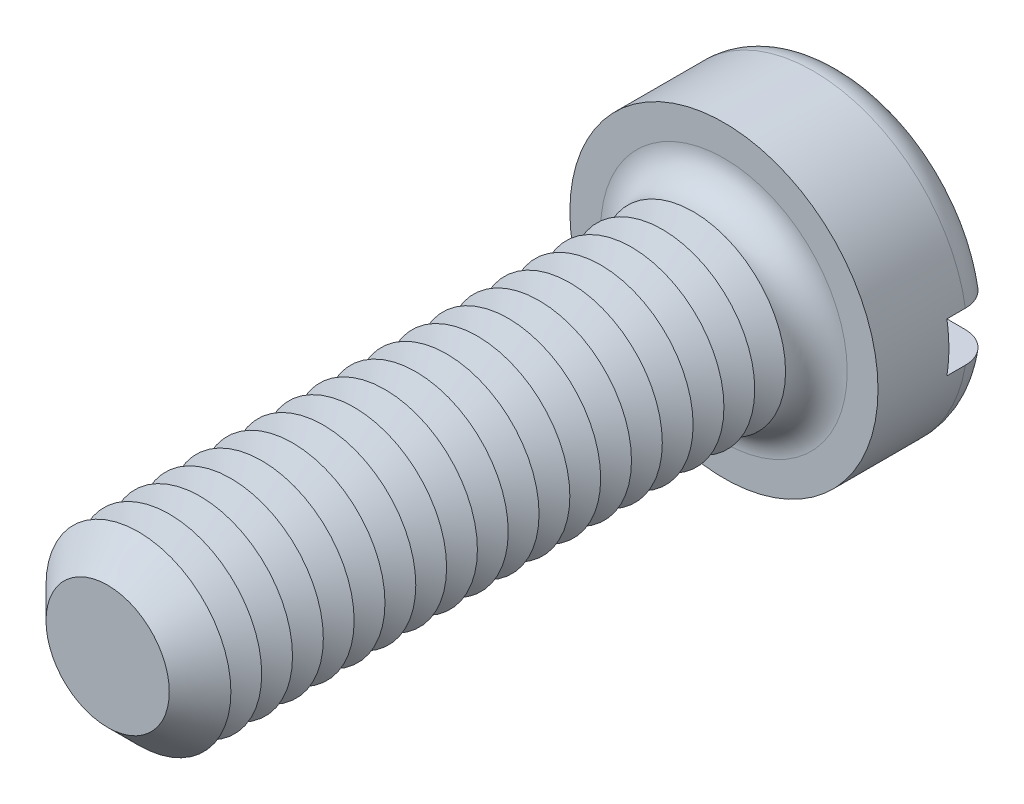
ISO-10303-21;
HEADER;
FILE_DESCRIPTION(('STEP AP214'),'2;1');
FILE_NAME('part.step','',(''),(''),'','','');
FILE_SCHEMA(('AUTOMOTIVE_DESIGN { 1 0 10303 214 1 1 1 1 }'));
ENDSEC;
DATA;
#1=APPLICATION_CONTEXT('core data for automotive mechanical design processes');
#2=APPLICATION_PROTOCOL_DEFINITION('international standard','automotive_design',2000,#1);
#3=PRODUCT_CONTEXT('',#1,'mechanical');
#4=PRODUCT('Part','Part','',(#3));
#5=PRODUCT_RELATED_PRODUCT_CATEGORY('part','',(#4));
#6=PRODUCT_DEFINITION_FORMATION('','',#4);
#7=PRODUCT_DEFINITION_CONTEXT('part definition',#1,'design');
#8=PRODUCT_DEFINITION('design','',#6,#7);
#9=PRODUCT_DEFINITION_SHAPE('','',#8);
#10=(LENGTH_UNIT() NAMED_UNIT(*) SI_UNIT(.MILLI.,.METRE.));
#11=(NAMED_UNIT(*) PLANE_ANGLE_UNIT() SI_UNIT($,.RADIAN.));
#12=(NAMED_UNIT(*) SI_UNIT($,.STERADIAN.) SOLID_ANGLE_UNIT());
#13=UNCERTAINTY_MEASURE_WITH_UNIT(LENGTH_MEASURE(1.E-05),#10,'distance_accuracy_value','');
#14=(GEOMETRIC_REPRESENTATION_CONTEXT(3) GLOBAL_UNCERTAINTY_ASSIGNED_CONTEXT((#13)) GLOBAL_UNIT_ASSIGNED_CONTEXT((#10,
#11,#12)) REPRESENTATION_CONTEXT('',''));
#15=CARTESIAN_POINT('',(0.,0.,0.));
#16=DIRECTION('',(0.,0.,1.));
#17=DIRECTION('',(1.,0.,0.));
#18=AXIS2_PLACEMENT_3D('',#15,#16,#17);
#19=CARTESIAN_POINT('',(0.,0.,-3.9));
#20=DIRECTION('',(0.,0.,1.));
#21=DIRECTION('',(1.,0.,0.));
#22=AXIS2_PLACEMENT_3D('',#19,#20,#21);
#23=PLANE('',#22);
#24=CARTESIAN_POINT('',(0.,0.,-3.9));
#25=DIRECTION('',(0.,0.,1.));
#26=DIRECTION('',(1.,0.,0.));
#27=AXIS2_PLACEMENT_3D('',#24,#25,#26);
#28=CIRCLE('',#27,4.);
#29=CARTESIAN_POINT('',(-3.91918358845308,0.800000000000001,-3.9));
#30=VERTEX_POINT('',#29);
#31=CARTESIAN_POINT('',(3.91918358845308,0.8,-3.9));
#32=VERTEX_POINT('',#31);
#33=EDGE_CURVE('E116',#30,#32,#28,.F.);
#34=ORIENTED_EDGE('',*,*,#33,.T.);
#35=DIRECTION('',(1.,0.,0.));
#36=VECTOR('',#35,1.);
#37=CARTESIAN_POINT('',(-5.,0.800000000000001,-3.9));
#38=LINE('',#37,#36);
#39=EDGE_CURVE('E111',#30,#32,#38,.T.);
#40=ORIENTED_EDGE('',*,*,#39,.F.);
#41=EDGE_LOOP('',(#34,#40));
#42=FACE_BOUND('',#41,.T.);
#43=ADVANCED_FACE('F39',(#42),#23,.F.);
#44=CARTESIAN_POINT('',(0.,0.,-2.9));
#45=DIRECTION('',(0.,0.,1.));
#46=DIRECTION('',(1.,0.,0.));
#47=AXIS2_PLACEMENT_3D('',#44,#45,#46);
#48=TOROIDAL_SURFACE('',#47,4.,1.);
#49=CARTESIAN_POINT('',(-4.76648512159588,0.800000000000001,-3.45304061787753));
#50=CARTESIAN_POINT('',(-4.73486405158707,0.800000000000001,-3.50001565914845));
#51=CARTESIAN_POINT('',(-4.69920787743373,0.800000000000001,-3.54432871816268));
#52=CARTESIAN_POINT('',(-4.62090302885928,0.800000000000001,-3.62634638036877));
#53=CARTESIAN_POINT('',(-4.57824494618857,0.800000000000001,-3.66404194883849));
#54=CARTESIAN_POINT('',(-4.48726975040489,0.800000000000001,-3.73172278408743));
#55=CARTESIAN_POINT('',(-4.43895902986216,0.800000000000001,-3.76171664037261));
#56=CARTESIAN_POINT('',(-4.33804923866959,0.800000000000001,-3.81326437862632));
#57=CARTESIAN_POINT('',(-4.2854512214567,0.800000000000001,-3.8348203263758));
#58=CARTESIAN_POINT('',(-4.17679895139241,0.800000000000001,-3.86918431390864));
#59=CARTESIAN_POINT('',(-4.12071163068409,0.800000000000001,-3.88188775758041));
#60=CARTESIAN_POINT('',(-4.00720729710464,0.800000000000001,-3.89785932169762));
#61=CARTESIAN_POINT('',(-3.94979011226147,0.800000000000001,-3.9011262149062));
#62=CARTESIAN_POINT('',(-3.83429042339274,0.800000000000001,-3.89816676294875));
#63=CARTESIAN_POINT('',(-3.77621176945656,0.800000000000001,-3.89178937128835));
#64=CARTESIAN_POINT('',(-3.66191938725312,0.800000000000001,-3.8694726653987));
#65=CARTESIAN_POINT('',(-3.60570580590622,0.800000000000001,-3.85353259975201));
#66=CARTESIAN_POINT('',(-3.49618749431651,0.800000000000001,-3.81233202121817));
#67=CARTESIAN_POINT('',(-3.44291561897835,0.800000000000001,-3.78698406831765));
#68=CARTESIAN_POINT('',(-3.34140774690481,0.800000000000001,-3.72766098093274));
#69=CARTESIAN_POINT('',(-3.29317182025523,0.800000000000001,-3.69368572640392));
#70=CARTESIAN_POINT('',(-3.20343355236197,0.800000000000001,-3.6182054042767));
#71=CARTESIAN_POINT('',(-3.16189680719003,0.800000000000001,-3.57674128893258));
#72=CARTESIAN_POINT('',(-3.08658236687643,0.800000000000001,-3.48727547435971));
#73=CARTESIAN_POINT('',(-3.05280364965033,0.800000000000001,-3.43927463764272));
#74=CARTESIAN_POINT('',(-2.99489532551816,0.800000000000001,-3.33932895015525));
#75=CARTESIAN_POINT('',(-2.97055012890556,0.800000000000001,-3.28750911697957));
#76=CARTESIAN_POINT('',(-2.93124252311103,0.800000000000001,-3.18042600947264));
#77=CARTESIAN_POINT('',(-2.91627793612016,0.800000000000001,-3.12516353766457));
#78=CARTESIAN_POINT('',(-2.89663075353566,0.800000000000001,-3.01470560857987));
#79=CARTESIAN_POINT('',(-2.89162828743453,0.800000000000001,-2.95956691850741));
#80=CARTESIAN_POINT('',(-2.89112479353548,0.800000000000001,-2.84924961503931));
#81=CARTESIAN_POINT('',(-2.89562264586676,0.800000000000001,-2.79407100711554));
#82=CARTESIAN_POINT('',(-2.91379565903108,0.800000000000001,-2.6861912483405));
#83=CARTESIAN_POINT('',(-2.92731815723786,0.800000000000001,-2.63346424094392));
#84=CARTESIAN_POINT('',(-2.96290888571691,0.800000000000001,-2.53098203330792));
#85=CARTESIAN_POINT('',(-2.98497757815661,0.800000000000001,-2.48122699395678));
#86=CARTESIAN_POINT('',(-3.03728055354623,0.800000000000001,-2.38535286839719));
#87=CARTESIAN_POINT('',(-3.06761989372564,0.800000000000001,-2.33929117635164));
#88=CARTESIAN_POINT('',(-3.13537950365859,0.800000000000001,-2.2527125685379));
#89=CARTESIAN_POINT('',(-3.17280082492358,0.800000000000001,-2.21219647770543));
#90=CARTESIAN_POINT('',(-3.2549164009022,0.800000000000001,-2.13651195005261));
#91=CARTESIAN_POINT('',(-3.29980186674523,0.800000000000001,-2.10155095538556));
#92=CARTESIAN_POINT('',(-3.39467666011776,0.800000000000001,-2.03942270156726));
#93=CARTESIAN_POINT('',(-3.44466673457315,0.800000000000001,-2.01225658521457));
#94=CARTESIAN_POINT('',(-3.5497933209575,0.800000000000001,-1.96576935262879));
#95=CARTESIAN_POINT('',(-3.60503228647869,0.800000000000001,-1.94667963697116));
#96=CARTESIAN_POINT('',(-3.71791613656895,0.800000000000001,-1.91794308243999));
#97=CARTESIAN_POINT('',(-3.77556119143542,0.800000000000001,-1.90829691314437));
#98=CARTESIAN_POINT('',(-3.89221522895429,0.800000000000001,-1.89869331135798));
#99=CARTESIAN_POINT('',(-3.9512319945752,0.800000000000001,-1.89882985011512));
#100=CARTESIAN_POINT('',(-4.06839541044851,0.800000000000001,-1.90907818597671));
#101=CARTESIAN_POINT('',(-4.12654207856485,0.800000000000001,-1.91918977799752));
#102=CARTESIAN_POINT('',(-4.23988103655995,0.800000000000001,-1.9490667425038));
#103=CARTESIAN_POINT('',(-4.29509069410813,0.800000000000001,-1.96876615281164));
#104=CARTESIAN_POINT('',(-4.40134194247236,0.800000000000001,-2.01729572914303));
#105=CARTESIAN_POINT('',(-4.45238383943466,0.800000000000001,-2.04612522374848));
#106=CARTESIAN_POINT('',(-4.54801343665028,0.800000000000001,-2.1116316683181));
#107=CARTESIAN_POINT('',(-4.59268768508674,0.800000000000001,-2.14818225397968));
#108=CARTESIAN_POINT('',(-4.67513924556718,0.800000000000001,-2.22837632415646));
#109=CARTESIAN_POINT('',(-4.71291715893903,0.800000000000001,-2.27201918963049));
#110=CARTESIAN_POINT('',(-4.77986554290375,0.800000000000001,-2.36439990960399));
#111=CARTESIAN_POINT('',(-4.80916462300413,0.800000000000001,-2.41304457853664));
#112=CARTESIAN_POINT('',(-4.85906149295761,0.800000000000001,-2.51460659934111));
#113=CARTESIAN_POINT('',(-4.8796602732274,0.800000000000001,-2.56752346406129));
#114=CARTESIAN_POINT('',(-4.9113264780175,0.800000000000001,-2.67542592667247));
#115=CARTESIAN_POINT('',(-4.92250819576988,0.800000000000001,-2.73037800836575));
#116=CARTESIAN_POINT('',(-4.93542682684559,0.800000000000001,-2.84139649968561));
#117=CARTESIAN_POINT('',(-4.93716171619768,0.800000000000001,-2.89746314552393));
#118=CARTESIAN_POINT('',(-4.93114851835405,0.800000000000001,-3.00876455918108));
#119=CARTESIAN_POINT('',(-4.92345325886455,0.800000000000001,-3.0640022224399));
#120=CARTESIAN_POINT('',(-4.8989032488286,0.800000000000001,-3.17235240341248));
#121=CARTESIAN_POINT('',(-4.88205998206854,0.800000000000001,-3.22546749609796));
#122=CARTESIAN_POINT('',(-4.84819200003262,0.800000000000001,-3.30764066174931));
#123=CARTESIAN_POINT('',(-4.83390853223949,0.800000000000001,-3.33785845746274));
#124=CARTESIAN_POINT('',(-4.80237957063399,0.800000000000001,-3.39670633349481));
#125=CARTESIAN_POINT('',(-4.78513409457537,0.800000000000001,-3.42533642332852));
#126=CARTESIAN_POINT('',(-4.76648512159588,0.800000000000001,-3.45304061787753));
#127=B_SPLINE_CURVE_WITH_KNOTS('',3,(#49,#50,#51,#52,#53,#54,#55,#56,#57,#58,#59,#60,#61,#62,
#63,#64,#65,#66,#67,#68,#69,#70,#71,#72,#73,#74,#75,#76,#77,#78,#79,#80,#81,#82,#83,#84,#85,#86,
#87,#88,#89,#90,#91,#92,#93,#94,#95,#96,#97,#98,#99,#100,#101,#102,#103,#104,#105,#106,#107,
#108,#109,#110,#111,#112,#113,#114,#115,#116,#117,#118,#119,#120,#121,#122,#123,#124,#125,#126),
.UNSPECIFIED.,.T.,.F.,(4,2,2,2,2,2,2,2,2,2,2,2,2,2,2,2,2,2,2,2,2,2,2,2,2,2,2,2,2,2,2,2,2,2,2,2,
2,2,4),(0.,0.169755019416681,0.339740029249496,0.509534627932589,0.67928763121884,
0.851013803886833,1.02276230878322,1.19722869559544,1.37170879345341,1.54785292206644,
1.72399950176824,1.89921049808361,2.07439839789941,2.24530597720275,2.41617386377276,
2.58146078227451,2.74672821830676,2.90926852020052,3.0718176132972,3.2365363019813,
3.40127946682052,3.57118676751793,3.74111896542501,3.91563534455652,4.09016409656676,
4.26636956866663,4.4425714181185,4.61757781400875,4.79257134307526,4.96489650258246,
5.13720662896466,5.30674670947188,5.47626748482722,5.64369988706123,5.81116816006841,
5.97770254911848,6.14402836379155,6.24414438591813,6.34425980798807),.UNSPECIFIED.);
#128=CARTESIAN_POINT('',(-4.93558507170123,0.800000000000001,-2.9));
#129=VERTEX_POINT('',#128);
#130=EDGE_CURVE('E322',#129,#30,#127,.T.);
#131=ORIENTED_EDGE('',*,*,#130,.F.);
#132=CARTESIAN_POINT('',(0.,0.,-2.9));
#133=DIRECTION('',(0.,0.,1.));
#134=DIRECTION('',(1.,0.,0.));
#135=AXIS2_PLACEMENT_3D('',#132,#133,#134);
#136=CIRCLE('',#135,5.);
#137=CARTESIAN_POINT('',(4.93558507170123,0.8,-2.9));
#138=VERTEX_POINT('',#137);
#139=EDGE_CURVE('E124',#138,#129,#136,.T.);
#140=ORIENTED_EDGE('',*,*,#139,.F.);
#141=CARTESIAN_POINT('',(2.98553785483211,0.8,-3.31649797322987));
#142=CARTESIAN_POINT('',(3.00991125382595,0.8,-3.36788093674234));
#143=CARTESIAN_POINT('',(3.03875556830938,0.8,-3.41719756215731));
#144=CARTESIAN_POINT('',(3.1043993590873,0.8,-3.51028676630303));
#145=CARTESIAN_POINT('',(3.1412115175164,0.8,-3.55405032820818));
#146=CARTESIAN_POINT('',(3.22153641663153,0.8,-3.63476402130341));
#147=CARTESIAN_POINT('',(3.26503706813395,0.8,-3.67172618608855));
#148=CARTESIAN_POINT('',(3.35749627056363,0.8,-3.73799476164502));
#149=CARTESIAN_POINT('',(3.4064533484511,0.8,-3.76730323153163));
#150=CARTESIAN_POINT('',(3.5095773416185,0.8,-3.81809642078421));
#151=CARTESIAN_POINT('',(3.56383317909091,0.8,-3.83940072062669));
#152=CARTESIAN_POINT('',(3.67513017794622,0.8,-3.87272481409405));
#153=CARTESIAN_POINT('',(3.7321717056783,0.8,-3.88474338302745));
#154=CARTESIAN_POINT('',(3.84815688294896,0.8,-3.89923413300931));
#155=CARTESIAN_POINT('',(3.90711516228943,0.8,-3.9015896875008));
#156=CARTESIAN_POINT('',(4.02458610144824,0.8,-3.89631753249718));
#157=CARTESIAN_POINT('',(4.08309876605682,0.8,-3.8886899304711));
#158=CARTESIAN_POINT('',(4.19768646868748,0.8,-3.86366584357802));
#159=CARTESIAN_POINT('',(4.25377243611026,0.8,-3.84631948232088));
#160=CARTESIAN_POINT('',(4.3621676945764,0.8,-3.80231797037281));
#161=CARTESIAN_POINT('',(4.41447726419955,0.8,-3.77566350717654));
#162=CARTESIAN_POINT('',(4.51300872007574,0.8,-3.71421163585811));
#163=CARTESIAN_POINT('',(4.5593085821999,0.8,-3.67953927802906));
#164=CARTESIAN_POINT('',(4.64530675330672,0.8,-3.60279495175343));
#165=CARTESIAN_POINT('',(4.68500564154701,0.8,-3.56072363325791));
#166=CARTESIAN_POINT('',(4.75599202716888,0.8,-3.47111750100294));
#167=CARTESIAN_POINT('',(4.7874061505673,0.8,-3.42368298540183));
#168=CARTESIAN_POINT('',(4.84170328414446,0.8,-3.32415927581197));
#169=CARTESIAN_POINT('',(4.86458695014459,0.8,-3.2720704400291));
#170=CARTESIAN_POINT('',(4.90088120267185,0.8,-3.16544016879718));
#171=CARTESIAN_POINT('',(4.91440984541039,0.8,-3.11093889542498));
#172=CARTESIAN_POINT('',(4.93205429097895,0.8,-3.00043391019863));
#173=CARTESIAN_POINT('',(4.93617053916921,0.8,-2.9444302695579));
#174=CARTESIAN_POINT('',(4.93486973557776,0.8,-2.83292218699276));
#175=CARTESIAN_POINT('',(4.92951827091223,0.8,-2.77741696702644));
#176=CARTESIAN_POINT('',(4.90957104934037,0.8,-2.66809456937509));
#177=CARTESIAN_POINT('',(4.89497541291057,0.8,-2.61427736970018));
#178=CARTESIAN_POINT('',(4.85697876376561,0.8,-2.50985095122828));
#179=CARTESIAN_POINT('',(4.83357805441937,0.8,-2.45924162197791));
#180=CARTESIAN_POINT('',(4.77866660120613,0.8,-2.36263484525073));
#181=CARTESIAN_POINT('',(4.74715567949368,0.8,-2.31663749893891));
#182=CARTESIAN_POINT('',(4.67670791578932,0.8,-2.23021464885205));
#183=CARTESIAN_POINT('',(4.6377224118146,0.8,-2.1898288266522));
#184=CARTESIAN_POINT('',(4.55359880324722,0.8,-2.11607828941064));
#185=CARTESIAN_POINT('',(4.50846036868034,0.8,-2.08271395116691));
#186=CARTESIAN_POINT('',(4.41271544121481,0.8,-2.02349513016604));
#187=CARTESIAN_POINT('',(4.36204749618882,0.8,-1.99774003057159));
#188=CARTESIAN_POINT('',(4.257155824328,0.8,-1.95495040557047));
#189=CARTESIAN_POINT('',(4.20293181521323,0.8,-1.93791657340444));
#190=CARTESIAN_POINT('',(4.09154156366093,0.8,-1.91276335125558));
#191=CARTESIAN_POINT('',(4.03434212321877,0.8,-1.90479098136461));
#192=CARTESIAN_POINT('',(3.91941228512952,0.8,-1.89840884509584));
#193=CARTESIAN_POINT('',(3.8616818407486,0.8,-1.89999992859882));
#194=CARTESIAN_POINT('',(3.7464111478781,0.8,-1.91275144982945));
#195=CARTESIAN_POINT('',(3.6888866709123,0.8,-1.92405471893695));
#196=CARTESIAN_POINT('',(3.57652290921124,0.8,-1.95609086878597));
#197=CARTESIAN_POINT('',(3.52168382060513,0.8,-1.97682443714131));
#198=CARTESIAN_POINT('',(3.41589179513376,0.8,-2.02733294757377));
#199=CARTESIAN_POINT('',(3.36496676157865,0.8,-2.05716640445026));
#200=CARTESIAN_POINT('',(3.26890903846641,0.8,-2.12504079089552));
#201=CARTESIAN_POINT('',(3.22377627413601,0.8,-2.16308161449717));
#202=CARTESIAN_POINT('',(3.141135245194,0.8,-2.24593284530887));
#203=CARTESIAN_POINT('',(3.1035541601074,0.8,-2.29067053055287));
#204=CARTESIAN_POINT('',(3.03669700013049,0.8,-2.38597317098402));
#205=CARTESIAN_POINT('',(3.00741914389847,0.8,-2.43653687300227));
#206=CARTESIAN_POINT('',(2.95891799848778,0.8,-2.54052959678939));
#207=CARTESIAN_POINT('',(2.93943249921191,0.8,-2.59383627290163));
#208=CARTESIAN_POINT('',(2.9100081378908,0.8,-2.70303736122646));
#209=CARTESIAN_POINT('',(2.90006970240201,0.8,-2.75893188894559));
#210=CARTESIAN_POINT('',(2.89027863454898,0.8,-2.86986958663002));
#211=CARTESIAN_POINT('',(2.89012791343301,0.8,-2.92488680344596));
#212=CARTESIAN_POINT('',(2.89917145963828,0.8,-3.03409648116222));
#213=CARTESIAN_POINT('',(2.90835313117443,0.8,-3.08828995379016));
#214=CARTESIAN_POINT('',(2.92977618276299,0.8,-3.17141652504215));
#215=CARTESIAN_POINT('',(2.93899011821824,0.8,-3.20116372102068));
#216=CARTESIAN_POINT('',(2.96020249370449,0.8,-3.25964614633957));
#217=CARTESIAN_POINT('',(2.97220082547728,0.8,-3.28838141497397));
#218=CARTESIAN_POINT('',(2.98553785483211,0.8,-3.31649797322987));
#219=B_SPLINE_CURVE_WITH_KNOTS('',3,(#141,#142,#143,#144,#145,#146,#147,#148,#149,#150,#151,
#152,#153,#154,#155,#156,#157,#158,#159,#160,#161,#162,#163,#164,#165,#166,#167,#168,#169,#170,
#171,#172,#173,#174,#175,#176,#177,#178,#179,#180,#181,#182,#183,#184,#185,#186,#187,#188,#189,
#190,#191,#192,#193,#194,#195,#196,#197,#198,#199,#200,#201,#202,#203,#204,#205,#206,#207,#208,
#209,#210,#211,#212,#213,#214,#215,#216,#217,#218),.UNSPECIFIED.,.T.,.F.,(4,2,2,2,2,2,2,2,2,2,2,
2,2,2,2,2,2,2,2,2,2,2,2,2,2,2,2,2,2,2,2,2,2,2,2,2,2,2,4),(0.,0.170493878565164,
0.341261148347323,0.511723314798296,0.682139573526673,0.856194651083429,1.03027268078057,
1.20644565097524,1.38261672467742,1.55788746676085,1.73314526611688,1.90583484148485,
2.07850925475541,2.24836742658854,2.41821253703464,2.58587311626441,2.75352576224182,
2.92002154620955,3.08651516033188,3.25300303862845,3.41949456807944,3.58710926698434,
3.75473295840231,3.92445790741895,4.09419634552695,4.26665110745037,4.43912119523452,
4.61417197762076,4.78923552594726,4.96544940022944,5.1416609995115,5.31608191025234,
5.49046537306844,5.65989063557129,5.82932346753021,5.99359365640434,6.157642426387,
6.250939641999,6.34423323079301),.UNSPECIFIED.);
#220=EDGE_CURVE('E324',#32,#138,#219,.T.);
#221=ORIENTED_EDGE('',*,*,#220,.F.);
#222=ORIENTED_EDGE('',*,*,#33,.F.);
#223=EDGE_LOOP('',(#131,#140,#221,#222));
#224=FACE_BOUND('',#223,.T.);
#225=ADVANCED_FACE('F306',(#224),#48,.T.);
#226=CARTESIAN_POINT('',(0.,0.,-3.9));
#227=DIRECTION('',(0.,0.,1.));
#228=DIRECTION('',(1.,0.,0.));
#229=AXIS2_PLACEMENT_3D('',#226,#227,#228);
#230=CYLINDRICAL_SURFACE('',#229,5.);
#231=DIRECTION('',(0.,0.,1.));
#232=VECTOR('',#231,1.);
#233=CARTESIAN_POINT('',(4.93558507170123,0.8,-3.9));
#234=LINE('',#233,#232);
#235=CARTESIAN_POINT('',(4.93558507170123,0.8,-2.3));
#236=VERTEX_POINT('',#235);
#237=EDGE_CURVE('E340',#138,#236,#234,.T.);
#238=ORIENTED_EDGE('',*,*,#237,.F.);
#239=ORIENTED_EDGE('',*,*,#139,.T.);
#240=DIRECTION('',(0.,0.,1.));
#241=VECTOR('',#240,1.);
#242=CARTESIAN_POINT('',(-4.93558507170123,0.800000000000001,-3.9));
#243=LINE('',#242,#241);
#244=CARTESIAN_POINT('',(-4.93558507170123,0.800000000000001,-2.3));
#245=VERTEX_POINT('',#244);
#246=EDGE_CURVE('E63',#245,#129,#243,.F.);
#247=ORIENTED_EDGE('',*,*,#246,.F.);
#248=CARTESIAN_POINT('',(0.,0.,-2.3));
#249=DIRECTION('',(0.,0.,-1.));
#250=DIRECTION('',(-1.,0.,0.));
#251=AXIS2_PLACEMENT_3D('',#248,#249,#250);
#252=CIRCLE('',#251,5.);
#253=CARTESIAN_POINT('',(-4.93558507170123,-0.799999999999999,-2.3));
#254=VERTEX_POINT('',#253);
#255=EDGE_CURVE('E43',#245,#254,#252,.F.);
#256=ORIENTED_EDGE('',*,*,#255,.T.);
#257=DIRECTION('',(0.,0.,1.));
#258=VECTOR('',#257,1.);
#259=CARTESIAN_POINT('',(-4.93558507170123,-0.799999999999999,-3.9));
#260=LINE('',#259,#258);
#261=CARTESIAN_POINT('',(-4.93558507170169,-0.799999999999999,-2.89999999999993));
#262=VERTEX_POINT('',#261);
#263=EDGE_CURVE('E337',#262,#254,#260,.T.);
#264=ORIENTED_EDGE('',*,*,#263,.F.);
#265=CARTESIAN_POINT('',(4.93558507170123,-0.8,-2.9));
#266=VERTEX_POINT('',#265);
#267=EDGE_CURVE('E126',#262,#266,#136,.T.);
#268=ORIENTED_EDGE('',*,*,#267,.T.);
#269=DIRECTION('',(0.,0.,1.));
#270=VECTOR('',#269,1.);
#271=CARTESIAN_POINT('',(4.93558507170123,-0.8,-3.9));
#272=LINE('',#271,#270);
#273=CARTESIAN_POINT('',(4.93558507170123,-0.8,-2.3));
#274=VERTEX_POINT('',#273);
#275=EDGE_CURVE('E55',#274,#266,#272,.F.);
#276=ORIENTED_EDGE('',*,*,#275,.F.);
#277=EDGE_CURVE('E11',#274,#236,#252,.F.);
#278=ORIENTED_EDGE('',*,*,#277,.T.);
#279=EDGE_LOOP('',(#238,#239,#247,#256,#264,#268,#276,#278));
#280=FACE_BOUND('',#279,.T.);
#281=CARTESIAN_POINT('',(0.,0.,0.));
#282=DIRECTION('',(0.,0.,1.));
#283=DIRECTION('',(1.,0.,0.));
#284=AXIS2_PLACEMENT_3D('',#281,#282,#283);
#285=CIRCLE('',#284,5.);
#286=CARTESIAN_POINT('',(5.,0.,0.));
#287=VERTEX_POINT('',#286);
#288=EDGE_CURVE('E343',#287,#287,#285,.T.);
#289=ORIENTED_EDGE('',*,*,#288,.F.);
#290=EDGE_LOOP('',(#289));
#291=FACE_BOUND('',#290,.T.);
#292=ADVANCED_FACE('F302',(#280,#291),#230,.T.);
#293=CARTESIAN_POINT('',(3.91918358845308,-0.8,-3.9));
#294=VERTEX_POINT('',#293);
#295=CARTESIAN_POINT('',(-3.91918358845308,-0.799999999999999,-3.9));
#296=VERTEX_POINT('',#295);
#297=EDGE_CURVE('E109',#294,#296,#28,.F.);
#298=ORIENTED_EDGE('',*,*,#297,.T.);
#299=DIRECTION('',(-1.,0.,0.));
#300=VECTOR('',#299,1.);
#301=CARTESIAN_POINT('',(-5.,-0.799999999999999,-3.9));
#302=LINE('',#301,#300);
#303=EDGE_CURVE('E96',#294,#296,#302,.T.);
#304=ORIENTED_EDGE('',*,*,#303,.F.);
#305=EDGE_LOOP('',(#298,#304));
#306=FACE_BOUND('',#305,.T.);
#307=ADVANCED_FACE('F108',(#306),#23,.F.);
#308=CARTESIAN_POINT('',(0.,0.,0.));
#309=DIRECTION('',(0.,0.,1.));
#310=DIRECTION('',(1.,0.,0.));
#311=AXIS2_PLACEMENT_3D('',#308,#309,#310);
#312=PLANE('',#311);
#313=CARTESIAN_POINT('',(0.,0.,0.));
#314=DIRECTION('',(0.,0.,1.));
#315=DIRECTION('',(1.,0.,0.));
#316=AXIS2_PLACEMENT_3D('',#313,#314,#315);
#317=CIRCLE('',#316,4.);
#318=CARTESIAN_POINT('',(4.,0.,0.));
#319=VERTEX_POINT('',#318);
#320=EDGE_CURVE('E115',#319,#319,#317,.F.);
#321=ORIENTED_EDGE('',*,*,#320,.T.);
#322=EDGE_LOOP('',(#321));
#323=FACE_BOUND('',#322,.T.);
#324=ORIENTED_EDGE('',*,*,#288,.T.);
#325=EDGE_LOOP('',(#324));
#326=FACE_BOUND('',#325,.T.);
#327=ADVANCED_FACE('F301',(#323,#326),#312,.T.);
#328=CARTESIAN_POINT('',(-4.76648512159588,-0.799999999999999,-3.45304061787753));
#329=CARTESIAN_POINT('',(-4.7975694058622,-0.799999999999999,-3.40685392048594));
#330=CARTESIAN_POINT('',(-4.82479903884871,-0.799999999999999,-3.35802740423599));
#331=CARTESIAN_POINT('',(-4.87070632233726,-0.799999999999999,-3.25646127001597));
#332=CARTESIAN_POINT('',(-4.8893747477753,-0.799999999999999,-3.20371750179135));
#333=CARTESIAN_POINT('',(-4.91756720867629,-0.799999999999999,-3.09584501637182));
#334=CARTESIAN_POINT('',(-4.92709302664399,-0.799999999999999,-3.04071676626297));
#335=CARTESIAN_POINT('',(-4.93671217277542,-0.799999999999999,-2.92965669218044));
#336=CARTESIAN_POINT('',(-4.93680767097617,-0.799999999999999,-2.87372505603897));
#337=CARTESIAN_POINT('',(-4.92758675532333,-0.799999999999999,-2.76284675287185));
#338=CARTESIAN_POINT('',(-4.91830421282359,-0.799999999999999,-2.70789726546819));
#339=CARTESIAN_POINT('',(-4.89065741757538,-0.799999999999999,-2.60033228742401));
#340=CARTESIAN_POINT('',(-4.87229291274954,-0.799999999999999,-2.54771686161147));
#341=CARTESIAN_POINT('',(-4.82699855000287,-0.799999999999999,-2.44622441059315));
#342=CARTESIAN_POINT('',(-4.80005659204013,-0.799999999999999,-2.39735278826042));
#343=CARTESIAN_POINT('',(-4.73841244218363,-0.799999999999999,-2.30477947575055));
#344=CARTESIAN_POINT('',(-4.70371003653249,-0.799999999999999,-2.26107792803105));
#345=CARTESIAN_POINT('',(-4.62724516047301,-0.799999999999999,-2.17969334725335));
#346=CARTESIAN_POINT('',(-4.58542787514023,-0.799999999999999,-2.14206183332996));
#347=CARTESIAN_POINT('',(-4.49614171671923,-0.799999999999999,-2.07424284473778));
#348=CARTESIAN_POINT('',(-4.44867251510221,-0.799999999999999,-2.04405580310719));
#349=CARTESIAN_POINT('',(-4.34875035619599,-0.799999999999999,-1.99153688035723));
#350=CARTESIAN_POINT('',(-4.29623870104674,-0.799999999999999,-1.96931670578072));
#351=CARTESIAN_POINT('',(-4.18826905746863,-0.799999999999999,-1.93384994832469));
#352=CARTESIAN_POINT('',(-4.1328108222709,-0.799999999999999,-1.92060411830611));
#353=CARTESIAN_POINT('',(-4.01956054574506,-0.799999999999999,-1.90323798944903));
#354=CARTESIAN_POINT('',(-3.96174522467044,-0.799999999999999,-1.89926947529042));
#355=CARTESIAN_POINT('',(-3.84625419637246,-0.799999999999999,-1.90095183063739));
#356=CARTESIAN_POINT('',(-3.78857850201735,-0.799999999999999,-1.90660355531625));
#357=CARTESIAN_POINT('',(-3.67415602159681,-0.799999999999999,-1.92748272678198));
#358=CARTESIAN_POINT('',(-3.61743328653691,-0.799999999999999,-1.94284216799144));
#359=CARTESIAN_POINT('',(-3.50734962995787,-0.799999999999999,-1.9828275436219));
#360=CARTESIAN_POINT('',(-3.4539889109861,-0.799999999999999,-2.00745403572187));
#361=CARTESIAN_POINT('',(-3.35197118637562,-0.799999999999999,-2.06542964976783));
#362=CARTESIAN_POINT('',(-3.30333217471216,-0.799999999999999,-2.0988104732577));
#363=CARTESIAN_POINT('',(-3.21244692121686,-0.799999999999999,-2.17337326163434));
#364=CARTESIAN_POINT('',(-3.17020039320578,-0.799999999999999,-2.21455487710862));
#365=CARTESIAN_POINT('',(-3.0940098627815,-0.799999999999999,-2.30296695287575));
#366=CARTESIAN_POINT('',(-3.05995540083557,-0.799999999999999,-2.35010211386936));
#367=CARTESIAN_POINT('',(-3.00053815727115,-0.799999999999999,-2.4495670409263));
#368=CARTESIAN_POINT('',(-2.97517362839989,-0.799999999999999,-2.50189576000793));
#369=CARTESIAN_POINT('',(-2.93470320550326,-0.799999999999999,-2.60853979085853));
#370=CARTESIAN_POINT('',(-2.91930557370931,-0.799999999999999,-2.66274437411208));
#371=CARTESIAN_POINT('',(-2.89812734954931,-0.799999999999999,-2.77299836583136));
#372=CARTESIAN_POINT('',(-2.89234481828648,-0.799999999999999,-2.82904740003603));
#373=CARTESIAN_POINT('',(-2.89064073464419,-0.799999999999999,-2.93970612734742));
#374=CARTESIAN_POINT('',(-2.89444549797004,-0.799999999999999,-2.99431180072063));
#375=CARTESIAN_POINT('',(-2.9112006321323,-0.799999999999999,-3.10209766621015));
#376=CARTESIAN_POINT('',(-2.9241507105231,-0.799999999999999,-3.1552779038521));
#377=CARTESIAN_POINT('',(-2.95868580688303,-0.799999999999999,-3.25858631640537));
#378=CARTESIAN_POINT('',(-2.98024709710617,-0.799999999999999,-3.30872244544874));
#379=CARTESIAN_POINT('',(-3.03128544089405,-0.799999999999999,-3.40478519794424));
#380=CARTESIAN_POINT('',(-3.06076335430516,-0.799999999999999,-3.45071136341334));
#381=CARTESIAN_POINT('',(-3.12753448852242,-0.799999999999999,-3.53826932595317));
#382=CARTESIAN_POINT('',(-3.16500083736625,-0.799999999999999,-3.57976901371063));
#383=CARTESIAN_POINT('',(-3.24617503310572,-0.799999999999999,-3.65613204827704));
#384=CARTESIAN_POINT('',(-3.28988388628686,-0.799999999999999,-3.69099432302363));
#385=CARTESIAN_POINT('',(-3.38380639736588,-0.799999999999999,-3.75424083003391));
#386=CARTESIAN_POINT('',(-3.43418287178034,-0.799999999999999,-3.78238342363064));
#387=CARTESIAN_POINT('',(-3.53887888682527,-0.799999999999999,-3.83000231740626));
#388=CARTESIAN_POINT('',(-3.59319889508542,-0.799999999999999,-3.84947758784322));
#389=CARTESIAN_POINT('',(-3.70539237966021,-0.799999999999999,-3.87954336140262));
#390=CARTESIAN_POINT('',(-3.76331464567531,-0.799999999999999,-3.88995217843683));
#391=CARTESIAN_POINT('',(-3.88008461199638,-0.799999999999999,-3.9009132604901));
#392=CARTESIAN_POINT('',(-3.93893230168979,-0.799999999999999,-3.9014656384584));
#393=CARTESIAN_POINT('',(-4.05594892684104,-0.799999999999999,-3.89264187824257));
#394=CARTESIAN_POINT('',(-4.11411702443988,-0.799999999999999,-3.88325457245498));
#395=CARTESIAN_POINT('',(-4.22802928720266,-0.799999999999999,-3.85472582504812));
#396=CARTESIAN_POINT('',(-4.28377297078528,-0.799999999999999,-3.83558245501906));
#397=CARTESIAN_POINT('',(-4.39054463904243,-0.799999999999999,-3.78829842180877));
#398=CARTESIAN_POINT('',(-4.44161887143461,-0.799999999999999,-3.76026208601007));
#399=CARTESIAN_POINT('',(-4.53818016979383,-0.799999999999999,-3.69589278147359));
#400=CARTESIAN_POINT('',(-4.58367442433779,-0.799999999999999,-3.65957066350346));
#401=CARTESIAN_POINT('',(-4.65208830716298,-0.799999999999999,-3.59453310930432));
#402=CARTESIAN_POINT('',(-4.67711825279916,-0.799999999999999,-3.56800018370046));
#403=CARTESIAN_POINT('',(-4.72414423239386,-0.799999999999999,-3.51236863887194));
#404=CARTESIAN_POINT('',(-4.74614029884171,-0.799999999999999,-3.48327004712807));
#405=CARTESIAN_POINT('',(-4.76648512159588,-0.799999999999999,-3.45304061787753));
#406=B_SPLINE_CURVE_WITH_KNOTS('',3,(#328,#329,#330,#331,#332,#333,#334,#335,#336,#337,#338,
#339,#340,#341,#342,#343,#344,#345,#346,#347,#348,#349,#350,#351,#352,#353,#354,#355,#356,#357,
#358,#359,#360,#361,#362,#363,#364,#365,#366,#367,#368,#369,#370,#371,#372,#373,#374,#375,#376,
#377,#378,#379,#380,#381,#382,#383,#384,#385,#386,#387,#388,#389,#390,#391,#392,#393,#394,#395,
#396,#397,#398,#399,#400,#401,#402,#403,#404,#405),.UNSPECIFIED.,.T.,.F.,(4,2,2,2,2,2,2,2,2,2,2,
2,2,2,2,2,2,2,2,2,2,2,2,2,2,2,2,2,2,2,2,2,2,2,2,2,2,2,4),(0.,0.166886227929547,
0.333951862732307,0.500984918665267,0.667979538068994,0.834373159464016,1.00077139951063,
1.16740542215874,1.33404403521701,1.50202999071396,1.67002571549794,1.84029248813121,
2.01057354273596,2.18362161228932,2.35668506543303,2.53215380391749,2.70763310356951,
2.88375684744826,3.05987270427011,3.23346085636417,3.40701408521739,3.57522519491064,
3.74340238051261,3.90683338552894,4.0702591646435,4.23323770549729,4.39623395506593,
4.56320691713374,4.7302068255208,4.90252468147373,5.07486300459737,5.25058028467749,
5.42629555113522,5.60220844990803,5.77815613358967,5.95211162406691,6.12584060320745,
6.23506966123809,6.34429754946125),.UNSPECIFIED.);
#407=EDGE_CURVE('E103',#296,#262,#406,.T.);
#408=ORIENTED_EDGE('',*,*,#407,.F.);
#409=ORIENTED_EDGE('',*,*,#297,.F.);
#410=CARTESIAN_POINT('',(2.98553785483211,-0.8,-3.31649797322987));
#411=CARTESIAN_POINT('',(2.96216773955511,-0.8,-3.26721849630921));
#412=CARTESIAN_POINT('',(2.94287503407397,-0.8,-3.21596872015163));
#413=CARTESIAN_POINT('',(2.91313258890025,-0.8,-3.11092723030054));
#414=CARTESIAN_POINT('',(2.9026902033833,-0.8,-3.0571334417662));
#415=CARTESIAN_POINT('',(2.89104377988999,-0.8,-2.94853922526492));
#416=CARTESIAN_POINT('',(2.88984130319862,-0.8,-2.89373862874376));
#417=CARTESIAN_POINT('',(2.89672585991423,-0.8,-2.78473646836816));
#418=CARTESIAN_POINT('',(2.90481120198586,-0.8,-2.73053479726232));
#419=CARTESIAN_POINT('',(2.92989134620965,-0.8,-2.62460092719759));
#420=CARTESIAN_POINT('',(2.94682969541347,-0.8,-2.57285532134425));
#421=CARTESIAN_POINT('',(2.9889990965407,-0.8,-2.47286425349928));
#422=CARTESIAN_POINT('',(3.01423103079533,-0.8,-2.42461916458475));
#423=CARTESIAN_POINT('',(3.07271536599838,-0.8,-2.33201565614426));
#424=CARTESIAN_POINT('',(3.10610710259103,-0.8,-2.28774532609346));
#425=CARTESIAN_POINT('',(3.17963417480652,-0.8,-2.205215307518));
#426=CARTESIAN_POINT('',(3.21977054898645,-0.8,-2.16695654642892));
#427=CARTESIAN_POINT('',(3.3070361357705,-0.8,-2.09624274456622));
#428=CARTESIAN_POINT('',(3.35434874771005,-0.8,-2.06401396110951));
#429=CARTESIAN_POINT('',(3.45361131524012,-0.8,-2.00773436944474));
#430=CARTESIAN_POINT('',(3.50556189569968,-0.8,-1.98368466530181));
#431=CARTESIAN_POINT('',(3.61398433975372,-0.8,-1.94389460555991));
#432=CARTESIAN_POINT('',(3.67053506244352,-0.8,-1.92836880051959));
#433=CARTESIAN_POINT('',(3.78543606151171,-0.8,-1.90696594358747));
#434=CARTESIAN_POINT('',(3.84378643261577,-0.8,-1.90108940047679));
#435=CARTESIAN_POINT('',(3.96100201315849,-0.8,-1.89918115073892));
#436=CARTESIAN_POINT('',(4.01986821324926,-0.8,-1.90320860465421));
#437=CARTESIAN_POINT('',(4.13606891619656,-0.8,-1.9211820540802));
#438=CARTESIAN_POINT('',(4.19340347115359,-0.8,-1.93512771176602));
#439=CARTESIAN_POINT('',(4.30434213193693,-0.8,-1.97243705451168));
#440=CARTESIAN_POINT('',(4.35797549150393,-0.8,-1.99571368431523));
#441=CARTESIAN_POINT('',(4.46048254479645,-0.8,-2.0510826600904));
#442=CARTESIAN_POINT('',(4.50935662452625,-0.8,-2.08317429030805));
#443=CARTESIAN_POINT('',(4.60012348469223,-0.8,-2.15471647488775));
#444=CARTESIAN_POINT('',(4.64211506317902,-0.8,-2.19404167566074));
#445=CARTESIAN_POINT('',(4.71877054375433,-0.8,-2.27928299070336));
#446=CARTESIAN_POINT('',(4.75343508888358,-0.8,-2.32519852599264));
#447=CARTESIAN_POINT('',(4.81388799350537,-0.8,-2.4215411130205));
#448=CARTESIAN_POINT('',(4.83980652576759,-0.8,-2.47188650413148));
#449=CARTESIAN_POINT('',(4.88271402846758,-0.8,-2.57624865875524));
#450=CARTESIAN_POINT('',(4.89970360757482,-0.8,-2.63026517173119));
#451=CARTESIAN_POINT('',(4.92409334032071,-0.8,-2.73978844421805));
#452=CARTESIAN_POINT('',(4.93159814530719,-0.8,-2.79527191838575));
#453=CARTESIAN_POINT('',(4.93713723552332,-0.8,-2.90670881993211));
#454=CARTESIAN_POINT('',(4.9351718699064,-0.8,-2.9626622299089));
#455=CARTESIAN_POINT('',(4.92186293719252,-0.8,-3.07317093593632));
#456=CARTESIAN_POINT('',(4.91056393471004,-0.8,-3.12773160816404));
#457=CARTESIAN_POINT('',(4.87898532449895,-0.8,-3.234187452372));
#458=CARTESIAN_POINT('',(4.85870572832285,-0.8,-3.28608262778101));
#459=CARTESIAN_POINT('',(4.80971634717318,-0.8,-3.38586723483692));
#460=CARTESIAN_POINT('',(4.78098824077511,-0.8,-3.43374766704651));
#461=CARTESIAN_POINT('',(4.71596686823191,-0.8,-3.52405937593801));
#462=CARTESIAN_POINT('',(4.67967336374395,-0.8,-3.56649048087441));
#463=CARTESIAN_POINT('',(4.60022577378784,-0.8,-3.64511036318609));
#464=CARTESIAN_POINT('',(4.5570143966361,-0.8,-3.6812412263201));
#465=CARTESIAN_POINT('',(4.4652099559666,-0.8,-3.7458530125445));
#466=CARTESIAN_POINT('',(4.41661654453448,-0.8,-3.77433344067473));
#467=CARTESIAN_POINT('',(4.31470683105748,-0.8,-3.82326981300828));
#468=CARTESIAN_POINT('',(4.26133399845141,-0.8,-3.84360800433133));
#469=CARTESIAN_POINT('',(4.15196444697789,-0.8,-3.87519515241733));
#470=CARTESIAN_POINT('',(4.09596750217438,-0.8,-3.88644332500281));
#471=CARTESIAN_POINT('',(3.98196469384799,-0.8,-3.89971870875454));
#472=CARTESIAN_POINT('',(3.92394096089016,-0.8,-3.901592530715));
#473=CARTESIAN_POINT('',(3.8083852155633,-0.8,-3.89570840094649));
#474=CARTESIAN_POINT('',(3.75085322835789,-0.8,-3.88794995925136));
#475=CARTESIAN_POINT('',(3.6371167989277,-0.8,-3.86287824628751));
#476=CARTESIAN_POINT('',(3.58093962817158,-0.8,-3.84544111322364));
#477=CARTESIAN_POINT('',(3.47227948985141,-0.8,-3.80139971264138));
#478=CARTESIAN_POINT('',(3.41979762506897,-0.8,-3.77479272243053));
#479=CARTESIAN_POINT('',(3.31994061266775,-0.8,-3.71304199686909));
#480=CARTESIAN_POINT('',(3.27257854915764,-0.8,-3.67787710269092));
#481=CARTESIAN_POINT('',(3.18459619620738,-0.8,-3.59999704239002));
#482=CARTESIAN_POINT('',(3.14396747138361,-0.8,-3.55729146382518));
#483=CARTESIAN_POINT('',(3.08341110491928,-0.8,-3.48140072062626));
#484=CARTESIAN_POINT('',(3.06118126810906,-0.8,-3.45002448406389));
#485=CARTESIAN_POINT('',(3.02047302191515,-0.8,-3.38492378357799));
#486=CARTESIAN_POINT('',(3.00199451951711,-0.8,-3.35119937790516));
#487=CARTESIAN_POINT('',(2.98553785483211,-0.8,-3.31649797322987));
#488=B_SPLINE_CURVE_WITH_KNOTS('',3,(#410,#411,#412,#413,#414,#415,#416,#417,#418,#419,#420,
#421,#422,#423,#424,#425,#426,#427,#428,#429,#430,#431,#432,#433,#434,#435,#436,#437,#438,#439,
#440,#441,#442,#443,#444,#445,#446,#447,#448,#449,#450,#451,#452,#453,#454,#455,#456,#457,#458,
#459,#460,#461,#462,#463,#464,#465,#466,#467,#468,#469,#470,#471,#472,#473,#474,#475,#476,#477,
#478,#479,#480,#481,#482,#483,#484,#485,#486,#487),.UNSPECIFIED.,.T.,.F.,(4,2,2,2,2,2,2,2,2,2,2,
2,2,2,2,2,2,2,2,2,2,2,2,2,2,2,2,2,2,2,2,2,2,2,2,2,2,2,4),(0.,0.163484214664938,
0.327104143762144,0.490751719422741,0.654369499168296,0.816956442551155,0.979560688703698,
1.14516376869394,1.31079237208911,1.48174839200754,1.6527274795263,1.82783306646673,
2.00294788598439,2.17911127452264,2.35526866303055,2.52981944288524,2.70435605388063,
2.87611266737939,3.04785420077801,3.21691347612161,3.38596122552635,3.55312700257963,
3.72028661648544,3.88665268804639,4.053018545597,4.2197478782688,4.38648246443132,
4.55467705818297,4.72288253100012,4.89343959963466,5.06401138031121,5.23736524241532,
5.41072792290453,5.58636211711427,5.76204850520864,5.93817375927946,6.11407667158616,
6.22920111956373,6.34432271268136),.UNSPECIFIED.);
#489=EDGE_CURVE('E92',#266,#294,#488,.T.);
#490=ORIENTED_EDGE('',*,*,#489,.F.);
#491=ORIENTED_EDGE('',*,*,#267,.F.);
#492=EDGE_LOOP('',(#408,#409,#490,#491));
#493=FACE_BOUND('',#492,.T.);
#494=ADVANCED_FACE('F113',(#493),#48,.T.);
#495=CARTESIAN_POINT('',(0.,0.,1.));
#496=DIRECTION('',(0.,0.,1.));
#497=DIRECTION('',(1.,0.,0.));
#498=AXIS2_PLACEMENT_3D('',#495,#496,#497);
#499=TOROIDAL_SURFACE('',#498,4.,1.);
#500=ORIENTED_EDGE('',*,*,#320,.F.);
#501=EDGE_LOOP('',(#500));
#502=FACE_BOUND('',#501,.T.);
#503=CARTESIAN_POINT('',(0.,0.,1.));
#504=DIRECTION('',(0.,0.,-1.));
#505=DIRECTION('',(-1.,0.,0.));
#506=AXIS2_PLACEMENT_3D('',#503,#504,#505);
#507=CIRCLE('',#506,3.);
#508=CARTESIAN_POINT('',(-3.,0.,1.));
#509=VERTEX_POINT('',#508);
#510=EDGE_CURVE('E349',#509,#509,#507,.T.);
#511=ORIENTED_EDGE('',*,*,#510,.T.);
#512=EDGE_LOOP('',(#511));
#513=FACE_BOUND('',#512,.T.);
#514=ADVANCED_FACE('F294',(#502,#513),#499,.F.);
#515=CARTESIAN_POINT('',(0.,0.,1.5));
#516=DIRECTION('',(0.,0.,-1.));
#517=DIRECTION('',(-1.,0.,0.));
#518=AXIS2_PLACEMENT_3D('',#515,#516,#517);
#519=CONICAL_SURFACE('',#518,2.13397459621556,1.0471975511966);
#520=ORIENTED_EDGE('',*,*,#510,.F.);
#521=EDGE_LOOP('',(#520));
#522=FACE_BOUND('',#521,.T.);
#523=CARTESIAN_POINT('',(0.,0.,1.5));
#524=DIRECTION('',(0.,0.,-1.));
#525=DIRECTION('',(-1.,0.,0.));
#526=AXIS2_PLACEMENT_3D('',#523,#524,#525);
#527=CIRCLE('',#526,2.13397459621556);
#528=CARTESIAN_POINT('',(-2.13397459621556,0.,1.5));
#529=VERTEX_POINT('',#528);
#530=EDGE_CURVE('E356',#529,#529,#527,.T.);
#531=ORIENTED_EDGE('',*,*,#530,.T.);
#532=EDGE_LOOP('',(#531));
#533=FACE_BOUND('',#532,.T.);
#534=ADVANCED_FACE('F290',(#522,#533),#519,.T.);
#535=CARTESIAN_POINT('',(0.,0.,2.));
#536=DIRECTION('',(0.,0.,1.));
#537=DIRECTION('',(1.,0.,0.));
#538=AXIS2_PLACEMENT_3D('',#535,#536,#537);
#539=CONICAL_SURFACE('',#538,3.,1.0471975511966);
#540=ORIENTED_EDGE('',*,*,#530,.F.);
#541=EDGE_LOOP('',(#540));
#542=FACE_BOUND('',#541,.T.);
#543=CARTESIAN_POINT('',(0.,0.,2.));
#544=DIRECTION('',(0.,0.,-1.));
#545=DIRECTION('',(-1.,0.,0.));
#546=AXIS2_PLACEMENT_3D('',#543,#544,#545);
#547=CIRCLE('',#546,3.);
#548=CARTESIAN_POINT('',(-3.,0.,2.));
#549=VERTEX_POINT('',#548);
#550=EDGE_CURVE('E362',#549,#549,#547,.T.);
#551=ORIENTED_EDGE('',*,*,#550,.T.);
#552=EDGE_LOOP('',(#551));
#553=FACE_BOUND('',#552,.T.);
#554=ADVANCED_FACE('F286',(#542,#553),#539,.T.);
#555=CARTESIAN_POINT('',(0.,0.,2.5));
#556=DIRECTION('',(0.,0.,-1.));
#557=DIRECTION('',(-1.,0.,0.));
#558=AXIS2_PLACEMENT_3D('',#555,#556,#557);
#559=CONICAL_SURFACE('',#558,2.13397459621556,1.0471975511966);
#560=ORIENTED_EDGE('',*,*,#550,.F.);
#561=EDGE_LOOP('',(#560));
#562=FACE_BOUND('',#561,.T.);
#563=CARTESIAN_POINT('',(0.,0.,2.5));
#564=DIRECTION('',(0.,0.,-1.));
#565=DIRECTION('',(-1.,0.,0.));
#566=AXIS2_PLACEMENT_3D('',#563,#564,#565);
#567=CIRCLE('',#566,2.13397459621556);
#568=CARTESIAN_POINT('',(-2.13397459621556,0.,2.5));
#569=VERTEX_POINT('',#568);
#570=EDGE_CURVE('E366',#569,#569,#567,.T.);
#571=ORIENTED_EDGE('',*,*,#570,.T.);
#572=EDGE_LOOP('',(#571));
#573=FACE_BOUND('',#572,.T.);
#574=ADVANCED_FACE('F282',(#562,#573),#559,.T.);
#575=CARTESIAN_POINT('',(0.,0.,3.));
#576=DIRECTION('',(0.,0.,1.));
#577=DIRECTION('',(1.,0.,0.));
#578=AXIS2_PLACEMENT_3D('',#575,#576,#577);
#579=CONICAL_SURFACE('',#578,3.,1.0471975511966);
#580=ORIENTED_EDGE('',*,*,#570,.F.);
#581=EDGE_LOOP('',(#580));
#582=FACE_BOUND('',#581,.T.);
#583=CARTESIAN_POINT('',(0.,0.,3.));
#584=DIRECTION('',(0.,0.,-1.));
#585=DIRECTION('',(-1.,0.,0.));
#586=AXIS2_PLACEMENT_3D('',#583,#584,#585);
#587=CIRCLE('',#586,3.);
#588=CARTESIAN_POINT('',(-3.,0.,3.));
#589=VERTEX_POINT('',#588);
#590=EDGE_CURVE('E369',#589,#589,#587,.T.);
#591=ORIENTED_EDGE('',*,*,#590,.T.);
#592=EDGE_LOOP('',(#591));
#593=FACE_BOUND('',#592,.T.);
#594=ADVANCED_FACE('F278',(#582,#593),#579,.T.);
#595=CARTESIAN_POINT('',(0.,0.,3.5));
#596=DIRECTION('',(0.,0.,-1.));
#597=DIRECTION('',(-1.,0.,0.));
#598=AXIS2_PLACEMENT_3D('',#595,#596,#597);
#599=CONICAL_SURFACE('',#598,2.13397459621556,1.0471975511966);
#600=ORIENTED_EDGE('',*,*,#590,.F.);
#601=EDGE_LOOP('',(#600));
#602=FACE_BOUND('',#601,.T.);
#603=CARTESIAN_POINT('',(0.,0.,3.5));
#604=DIRECTION('',(0.,0.,-1.));
#605=DIRECTION('',(-1.,0.,0.));
#606=AXIS2_PLACEMENT_3D('',#603,#604,#605);
#607=CIRCLE('',#606,2.13397459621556);
#608=CARTESIAN_POINT('',(-2.13397459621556,0.,3.5));
#609=VERTEX_POINT('',#608);
#610=EDGE_CURVE('E373',#609,#609,#607,.T.);
#611=ORIENTED_EDGE('',*,*,#610,.T.);
#612=EDGE_LOOP('',(#611));
#613=FACE_BOUND('',#612,.T.);
#614=ADVANCED_FACE('F274',(#602,#613),#599,.T.);
#615=CARTESIAN_POINT('',(0.,0.,4.));
#616=DIRECTION('',(0.,0.,1.));
#617=DIRECTION('',(1.,0.,0.));
#618=AXIS2_PLACEMENT_3D('',#615,#616,#617);
#619=CONICAL_SURFACE('',#618,3.,1.0471975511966);
#620=ORIENTED_EDGE('',*,*,#610,.F.);
#621=EDGE_LOOP('',(#620));
#622=FACE_BOUND('',#621,.T.);
#623=CARTESIAN_POINT('',(0.,0.,4.));
#624=DIRECTION('',(0.,0.,-1.));
#625=DIRECTION('',(-1.,0.,0.));
#626=AXIS2_PLACEMENT_3D('',#623,#624,#625);
#627=CIRCLE('',#626,3.);
#628=CARTESIAN_POINT('',(-3.,0.,4.));
#629=VERTEX_POINT('',#628);
#630=EDGE_CURVE('E377',#629,#629,#627,.T.);
#631=ORIENTED_EDGE('',*,*,#630,.T.);
#632=EDGE_LOOP('',(#631));
#633=FACE_BOUND('',#632,.T.);
#634=ADVANCED_FACE('F270',(#622,#633),#619,.T.);
#635=CARTESIAN_POINT('',(0.,0.,4.5));
#636=DIRECTION('',(0.,0.,-1.));
#637=DIRECTION('',(-1.,0.,0.));
#638=AXIS2_PLACEMENT_3D('',#635,#636,#637);
#639=CONICAL_SURFACE('',#638,2.13397459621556,1.0471975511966);
#640=ORIENTED_EDGE('',*,*,#630,.F.);
#641=EDGE_LOOP('',(#640));
#642=FACE_BOUND('',#641,.T.);
#643=CARTESIAN_POINT('',(0.,0.,4.5));
#644=DIRECTION('',(0.,0.,-1.));
#645=DIRECTION('',(-1.,0.,0.));
#646=AXIS2_PLACEMENT_3D('',#643,#644,#645);
#647=CIRCLE('',#646,2.13397459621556);
#648=CARTESIAN_POINT('',(-2.13397459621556,0.,4.5));
#649=VERTEX_POINT('',#648);
#650=EDGE_CURVE('E381',#649,#649,#647,.T.);
#651=ORIENTED_EDGE('',*,*,#650,.T.);
#652=EDGE_LOOP('',(#651));
#653=FACE_BOUND('',#652,.T.);
#654=ADVANCED_FACE('F266',(#642,#653),#639,.T.);
#655=CARTESIAN_POINT('',(0.,0.,5.));
#656=DIRECTION('',(0.,0.,1.));
#657=DIRECTION('',(1.,0.,0.));
#658=AXIS2_PLACEMENT_3D('',#655,#656,#657);
#659=CONICAL_SURFACE('',#658,3.,1.0471975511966);
#660=ORIENTED_EDGE('',*,*,#650,.F.);
#661=EDGE_LOOP('',(#660));
#662=FACE_BOUND('',#661,.T.);
#663=CARTESIAN_POINT('',(0.,0.,5.));
#664=DIRECTION('',(0.,0.,-1.));
#665=DIRECTION('',(-1.,0.,0.));
#666=AXIS2_PLACEMENT_3D('',#663,#664,#665);
#667=CIRCLE('',#666,3.);
#668=CARTESIAN_POINT('',(-3.,0.,5.));
#669=VERTEX_POINT('',#668);
#670=EDGE_CURVE('E385',#669,#669,#667,.T.);
#671=ORIENTED_EDGE('',*,*,#670,.T.);
#672=EDGE_LOOP('',(#671));
#673=FACE_BOUND('',#672,.T.);
#674=ADVANCED_FACE('F262',(#662,#673),#659,.T.);
#675=CARTESIAN_POINT('',(0.,0.,5.5));
#676=DIRECTION('',(0.,0.,-1.));
#677=DIRECTION('',(-1.,0.,0.));
#678=AXIS2_PLACEMENT_3D('',#675,#676,#677);
#679=CONICAL_SURFACE('',#678,2.13397459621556,1.0471975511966);
#680=ORIENTED_EDGE('',*,*,#670,.F.);
#681=EDGE_LOOP('',(#680));
#682=FACE_BOUND('',#681,.T.);
#683=CARTESIAN_POINT('',(0.,0.,5.5));
#684=DIRECTION('',(0.,0.,-1.));
#685=DIRECTION('',(-1.,0.,0.));
#686=AXIS2_PLACEMENT_3D('',#683,#684,#685);
#687=CIRCLE('',#686,2.13397459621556);
#688=CARTESIAN_POINT('',(-2.13397459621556,0.,5.5));
#689=VERTEX_POINT('',#688);
#690=EDGE_CURVE('E388',#689,#689,#687,.T.);
#691=ORIENTED_EDGE('',*,*,#690,.T.);
#692=EDGE_LOOP('',(#691));
#693=FACE_BOUND('',#692,.T.);
#694=ADVANCED_FACE('F258',(#682,#693),#679,.T.);
#695=CARTESIAN_POINT('',(0.,0.,6.));
#696=DIRECTION('',(0.,0.,1.));
#697=DIRECTION('',(1.,0.,0.));
#698=AXIS2_PLACEMENT_3D('',#695,#696,#697);
#699=CONICAL_SURFACE('',#698,3.,1.0471975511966);
#700=ORIENTED_EDGE('',*,*,#690,.F.);
#701=EDGE_LOOP('',(#700));
#702=FACE_BOUND('',#701,.T.);
#703=CARTESIAN_POINT('',(0.,0.,6.));
#704=DIRECTION('',(0.,0.,-1.));
#705=DIRECTION('',(-1.,0.,0.));
#706=AXIS2_PLACEMENT_3D('',#703,#704,#705);
#707=CIRCLE('',#706,3.);
#708=CARTESIAN_POINT('',(-3.,0.,6.));
#709=VERTEX_POINT('',#708);
#710=EDGE_CURVE('E392',#709,#709,#707,.T.);
#711=ORIENTED_EDGE('',*,*,#710,.T.);
#712=EDGE_LOOP('',(#711));
#713=FACE_BOUND('',#712,.T.);
#714=ADVANCED_FACE('F254',(#702,#713),#699,.T.);
#715=CARTESIAN_POINT('',(0.,0.,6.5));
#716=DIRECTION('',(0.,0.,-1.));
#717=DIRECTION('',(-1.,0.,0.));
#718=AXIS2_PLACEMENT_3D('',#715,#716,#717);
#719=CONICAL_SURFACE('',#718,2.13397459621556,1.0471975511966);
#720=ORIENTED_EDGE('',*,*,#710,.F.);
#721=EDGE_LOOP('',(#720));
#722=FACE_BOUND('',#721,.T.);
#723=CARTESIAN_POINT('',(0.,0.,6.5));
#724=DIRECTION('',(0.,0.,-1.));
#725=DIRECTION('',(-1.,0.,0.));
#726=AXIS2_PLACEMENT_3D('',#723,#724,#725);
#727=CIRCLE('',#726,2.13397459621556);
#728=CARTESIAN_POINT('',(-2.13397459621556,0.,6.5));
#729=VERTEX_POINT('',#728);
#730=EDGE_CURVE('E395',#729,#729,#727,.T.);
#731=ORIENTED_EDGE('',*,*,#730,.T.);
#732=EDGE_LOOP('',(#731));
#733=FACE_BOUND('',#732,.T.);
#734=ADVANCED_FACE('F250',(#722,#733),#719,.T.);
#735=CARTESIAN_POINT('',(0.,0.,7.));
#736=DIRECTION('',(0.,0.,1.));
#737=DIRECTION('',(1.,0.,0.));
#738=AXIS2_PLACEMENT_3D('',#735,#736,#737);
#739=CONICAL_SURFACE('',#738,3.,1.0471975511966);
#740=ORIENTED_EDGE('',*,*,#730,.F.);
#741=EDGE_LOOP('',(#740));
#742=FACE_BOUND('',#741,.T.);
#743=CARTESIAN_POINT('',(0.,0.,7.));
#744=DIRECTION('',(0.,0.,-1.));
#745=DIRECTION('',(-1.,0.,0.));
#746=AXIS2_PLACEMENT_3D('',#743,#744,#745);
#747=CIRCLE('',#746,3.);
#748=CARTESIAN_POINT('',(-3.,0.,7.));
#749=VERTEX_POINT('',#748);
#750=EDGE_CURVE('E399',#749,#749,#747,.T.);
#751=ORIENTED_EDGE('',*,*,#750,.T.);
#752=EDGE_LOOP('',(#751));
#753=FACE_BOUND('',#752,.T.);
#754=ADVANCED_FACE('F246',(#742,#753),#739,.T.);
#755=CARTESIAN_POINT('',(0.,0.,7.5));
#756=DIRECTION('',(0.,0.,-1.));
#757=DIRECTION('',(-1.,0.,0.));
#758=AXIS2_PLACEMENT_3D('',#755,#756,#757);
#759=CONICAL_SURFACE('',#758,2.13397459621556,1.0471975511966);
#760=ORIENTED_EDGE('',*,*,#750,.F.);
#761=EDGE_LOOP('',(#760));
#762=FACE_BOUND('',#761,.T.);
#763=CARTESIAN_POINT('',(0.,0.,7.5));
#764=DIRECTION('',(0.,0.,-1.));
#765=DIRECTION('',(-1.,0.,0.));
#766=AXIS2_PLACEMENT_3D('',#763,#764,#765);
#767=CIRCLE('',#766,2.13397459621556);
#768=CARTESIAN_POINT('',(-2.13397459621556,0.,7.5));
#769=VERTEX_POINT('',#768);
#770=EDGE_CURVE('E403',#769,#769,#767,.T.);
#771=ORIENTED_EDGE('',*,*,#770,.T.);
#772=EDGE_LOOP('',(#771));
#773=FACE_BOUND('',#772,.T.);
#774=ADVANCED_FACE('F242',(#762,#773),#759,.T.);
#775=CARTESIAN_POINT('',(0.,0.,8.));
#776=DIRECTION('',(0.,0.,1.));
#777=DIRECTION('',(1.,0.,0.));
#778=AXIS2_PLACEMENT_3D('',#775,#776,#777);
#779=CONICAL_SURFACE('',#778,3.,1.0471975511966);
#780=ORIENTED_EDGE('',*,*,#770,.F.);
#781=EDGE_LOOP('',(#780));
#782=FACE_BOUND('',#781,.T.);
#783=CARTESIAN_POINT('',(0.,0.,8.));
#784=DIRECTION('',(0.,0.,-1.));
#785=DIRECTION('',(-1.,0.,0.));
#786=AXIS2_PLACEMENT_3D('',#783,#784,#785);
#787=CIRCLE('',#786,3.);
#788=CARTESIAN_POINT('',(-3.,0.,8.));
#789=VERTEX_POINT('',#788);
#790=EDGE_CURVE('E407',#789,#789,#787,.T.);
#791=ORIENTED_EDGE('',*,*,#790,.T.);
#792=EDGE_LOOP('',(#791));
#793=FACE_BOUND('',#792,.T.);
#794=ADVANCED_FACE('F238',(#782,#793),#779,.T.);
#795=CARTESIAN_POINT('',(0.,0.,8.5));
#796=DIRECTION('',(0.,0.,-1.));
#797=DIRECTION('',(-1.,0.,0.));
#798=AXIS2_PLACEMENT_3D('',#795,#796,#797);
#799=CONICAL_SURFACE('',#798,2.13397459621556,1.0471975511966);
#800=ORIENTED_EDGE('',*,*,#790,.F.);
#801=EDGE_LOOP('',(#800));
#802=FACE_BOUND('',#801,.T.);
#803=CARTESIAN_POINT('',(0.,0.,8.5));
#804=DIRECTION('',(0.,0.,-1.));
#805=DIRECTION('',(-1.,0.,0.));
#806=AXIS2_PLACEMENT_3D('',#803,#804,#805);
#807=CIRCLE('',#806,2.13397459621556);
#808=CARTESIAN_POINT('',(-2.13397459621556,0.,8.5));
#809=VERTEX_POINT('',#808);
#810=EDGE_CURVE('E411',#809,#809,#807,.T.);
#811=ORIENTED_EDGE('',*,*,#810,.T.);
#812=EDGE_LOOP('',(#811));
#813=FACE_BOUND('',#812,.T.);
#814=ADVANCED_FACE('F234',(#802,#813),#799,.T.);
#815=CARTESIAN_POINT('',(0.,0.,9.));
#816=DIRECTION('',(0.,0.,1.));
#817=DIRECTION('',(1.,0.,0.));
#818=AXIS2_PLACEMENT_3D('',#815,#816,#817);
#819=CONICAL_SURFACE('',#818,3.,1.0471975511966);
#820=ORIENTED_EDGE('',*,*,#810,.F.);
#821=EDGE_LOOP('',(#820));
#822=FACE_BOUND('',#821,.T.);
#823=CARTESIAN_POINT('',(0.,0.,9.));
#824=DIRECTION('',(0.,0.,-1.));
#825=DIRECTION('',(-1.,0.,0.));
#826=AXIS2_PLACEMENT_3D('',#823,#824,#825);
#827=CIRCLE('',#826,3.);
#828=CARTESIAN_POINT('',(-3.,0.,9.));
#829=VERTEX_POINT('',#828);
#830=EDGE_CURVE('E415',#829,#829,#827,.T.);
#831=ORIENTED_EDGE('',*,*,#830,.T.);
#832=EDGE_LOOP('',(#831));
#833=FACE_BOUND('',#832,.T.);
#834=ADVANCED_FACE('F230',(#822,#833),#819,.T.);
#835=CARTESIAN_POINT('',(0.,0.,9.5));
#836=DIRECTION('',(0.,0.,-1.));
#837=DIRECTION('',(-1.,0.,0.));
#838=AXIS2_PLACEMENT_3D('',#835,#836,#837);
#839=CONICAL_SURFACE('',#838,2.13397459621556,1.0471975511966);
#840=ORIENTED_EDGE('',*,*,#830,.F.);
#841=EDGE_LOOP('',(#840));
#842=FACE_BOUND('',#841,.T.);
#843=CARTESIAN_POINT('',(0.,0.,9.5));
#844=DIRECTION('',(0.,0.,-1.));
#845=DIRECTION('',(-1.,0.,0.));
#846=AXIS2_PLACEMENT_3D('',#843,#844,#845);
#847=CIRCLE('',#846,2.13397459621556);
#848=CARTESIAN_POINT('',(-2.13397459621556,0.,9.5));
#849=VERTEX_POINT('',#848);
#850=EDGE_CURVE('E419',#849,#849,#847,.T.);
#851=ORIENTED_EDGE('',*,*,#850,.T.);
#852=EDGE_LOOP('',(#851));
#853=FACE_BOUND('',#852,.T.);
#854=ADVANCED_FACE('F226',(#842,#853),#839,.T.);
#855=CARTESIAN_POINT('',(0.,0.,10.));
#856=DIRECTION('',(0.,0.,1.));
#857=DIRECTION('',(1.,0.,0.));
#858=AXIS2_PLACEMENT_3D('',#855,#856,#857);
#859=CONICAL_SURFACE('',#858,3.,1.0471975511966);
#860=ORIENTED_EDGE('',*,*,#850,.F.);
#861=EDGE_LOOP('',(#860));
#862=FACE_BOUND('',#861,.T.);
#863=CARTESIAN_POINT('',(0.,0.,10.));
#864=DIRECTION('',(0.,0.,-1.));
#865=DIRECTION('',(-1.,0.,0.));
#866=AXIS2_PLACEMENT_3D('',#863,#864,#865);
#867=CIRCLE('',#866,3.);
#868=CARTESIAN_POINT('',(-3.,0.,10.));
#869=VERTEX_POINT('',#868);
#870=EDGE_CURVE('E423',#869,#869,#867,.T.);
#871=ORIENTED_EDGE('',*,*,#870,.T.);
#872=EDGE_LOOP('',(#871));
#873=FACE_BOUND('',#872,.T.);
#874=ADVANCED_FACE('F222',(#862,#873),#859,.T.);
#875=CARTESIAN_POINT('',(0.,0.,10.5));
#876=DIRECTION('',(0.,0.,-1.));
#877=DIRECTION('',(-1.,0.,0.));
#878=AXIS2_PLACEMENT_3D('',#875,#876,#877);
#879=CONICAL_SURFACE('',#878,2.13397459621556,1.0471975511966);
#880=ORIENTED_EDGE('',*,*,#870,.F.);
#881=EDGE_LOOP('',(#880));
#882=FACE_BOUND('',#881,.T.);
#883=CARTESIAN_POINT('',(0.,0.,10.5));
#884=DIRECTION('',(0.,0.,-1.));
#885=DIRECTION('',(-1.,0.,0.));
#886=AXIS2_PLACEMENT_3D('',#883,#884,#885);
#887=CIRCLE('',#886,2.13397459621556);
#888=CARTESIAN_POINT('',(-2.13397459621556,0.,10.5));
#889=VERTEX_POINT('',#888);
#890=EDGE_CURVE('E427',#889,#889,#887,.T.);
#891=ORIENTED_EDGE('',*,*,#890,.T.);
#892=EDGE_LOOP('',(#891));
#893=FACE_BOUND('',#892,.T.);
#894=ADVANCED_FACE('F218',(#882,#893),#879,.T.);
#895=CARTESIAN_POINT('',(0.,0.,11.));
#896=DIRECTION('',(0.,0.,1.));
#897=DIRECTION('',(1.,0.,0.));
#898=AXIS2_PLACEMENT_3D('',#895,#896,#897);
#899=CONICAL_SURFACE('',#898,3.,1.0471975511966);
#900=ORIENTED_EDGE('',*,*,#890,.F.);
#901=EDGE_LOOP('',(#900));
#902=FACE_BOUND('',#901,.T.);
#903=CARTESIAN_POINT('',(0.,0.,11.));
#904=DIRECTION('',(0.,0.,-1.));
#905=DIRECTION('',(-1.,0.,0.));
#906=AXIS2_PLACEMENT_3D('',#903,#904,#905);
#907=CIRCLE('',#906,3.);
#908=CARTESIAN_POINT('',(-3.,0.,11.));
#909=VERTEX_POINT('',#908);
#910=EDGE_CURVE('E431',#909,#909,#907,.T.);
#911=ORIENTED_EDGE('',*,*,#910,.T.);
#912=EDGE_LOOP('',(#911));
#913=FACE_BOUND('',#912,.T.);
#914=ADVANCED_FACE('F214',(#902,#913),#899,.T.);
#915=CARTESIAN_POINT('',(0.,0.,11.5));
#916=DIRECTION('',(0.,0.,-1.));
#917=DIRECTION('',(-1.,0.,0.));
#918=AXIS2_PLACEMENT_3D('',#915,#916,#917);
#919=CONICAL_SURFACE('',#918,2.13397459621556,1.0471975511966);
#920=ORIENTED_EDGE('',*,*,#910,.F.);
#921=EDGE_LOOP('',(#920));
#922=FACE_BOUND('',#921,.T.);
#923=CARTESIAN_POINT('',(0.,0.,11.5));
#924=DIRECTION('',(0.,0.,-1.));
#925=DIRECTION('',(-1.,0.,0.));
#926=AXIS2_PLACEMENT_3D('',#923,#924,#925);
#927=CIRCLE('',#926,2.13397459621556);
#928=CARTESIAN_POINT('',(-2.13397459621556,0.,11.5));
#929=VERTEX_POINT('',#928);
#930=EDGE_CURVE('E435',#929,#929,#927,.T.);
#931=ORIENTED_EDGE('',*,*,#930,.T.);
#932=EDGE_LOOP('',(#931));
#933=FACE_BOUND('',#932,.T.);
#934=ADVANCED_FACE('F210',(#922,#933),#919,.T.);
#935=CARTESIAN_POINT('',(0.,0.,12.));
#936=DIRECTION('',(0.,0.,1.));
#937=DIRECTION('',(1.,0.,0.));
#938=AXIS2_PLACEMENT_3D('',#935,#936,#937);
#939=CONICAL_SURFACE('',#938,3.,1.0471975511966);
#940=ORIENTED_EDGE('',*,*,#930,.F.);
#941=EDGE_LOOP('',(#940));
#942=FACE_BOUND('',#941,.T.);
#943=CARTESIAN_POINT('',(0.,0.,12.));
#944=DIRECTION('',(0.,0.,-1.));
#945=DIRECTION('',(-1.,0.,0.));
#946=AXIS2_PLACEMENT_3D('',#943,#944,#945);
#947=CIRCLE('',#946,3.);
#948=CARTESIAN_POINT('',(-3.,0.,12.));
#949=VERTEX_POINT('',#948);
#950=EDGE_CURVE('E439',#949,#949,#947,.T.);
#951=ORIENTED_EDGE('',*,*,#950,.T.);
#952=EDGE_LOOP('',(#951));
#953=FACE_BOUND('',#952,.T.);
#954=ADVANCED_FACE('F206',(#942,#953),#939,.T.);
#955=CARTESIAN_POINT('',(0.,0.,12.5));
#956=DIRECTION('',(0.,0.,-1.));
#957=DIRECTION('',(-1.,0.,0.));
#958=AXIS2_PLACEMENT_3D('',#955,#956,#957);
#959=CONICAL_SURFACE('',#958,2.13397459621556,1.0471975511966);
#960=ORIENTED_EDGE('',*,*,#950,.F.);
#961=EDGE_LOOP('',(#960));
#962=FACE_BOUND('',#961,.T.);
#963=CARTESIAN_POINT('',(0.,0.,12.5));
#964=DIRECTION('',(0.,0.,-1.));
#965=DIRECTION('',(-1.,0.,0.));
#966=AXIS2_PLACEMENT_3D('',#963,#964,#965);
#967=CIRCLE('',#966,2.13397459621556);
#968=CARTESIAN_POINT('',(-2.13397459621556,0.,12.5));
#969=VERTEX_POINT('',#968);
#970=EDGE_CURVE('E443',#969,#969,#967,.T.);
#971=ORIENTED_EDGE('',*,*,#970,.T.);
#972=EDGE_LOOP('',(#971));
#973=FACE_BOUND('',#972,.T.);
#974=ADVANCED_FACE('F202',(#962,#973),#959,.T.);
#975=CARTESIAN_POINT('',(0.,0.,13.));
#976=DIRECTION('',(0.,0.,1.));
#977=DIRECTION('',(1.,0.,0.));
#978=AXIS2_PLACEMENT_3D('',#975,#976,#977);
#979=CONICAL_SURFACE('',#978,3.,1.0471975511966);
#980=ORIENTED_EDGE('',*,*,#970,.F.);
#981=EDGE_LOOP('',(#980));
#982=FACE_BOUND('',#981,.T.);
#983=CARTESIAN_POINT('',(0.,0.,13.));
#984=DIRECTION('',(0.,0.,-1.));
#985=DIRECTION('',(-1.,0.,0.));
#986=AXIS2_PLACEMENT_3D('',#983,#984,#985);
#987=CIRCLE('',#986,3.);
#988=CARTESIAN_POINT('',(-3.,0.,13.));
#989=VERTEX_POINT('',#988);
#990=EDGE_CURVE('E446',#989,#989,#987,.T.);
#991=ORIENTED_EDGE('',*,*,#990,.T.);
#992=EDGE_LOOP('',(#991));
#993=FACE_BOUND('',#992,.T.);
#994=ADVANCED_FACE('F198',(#982,#993),#979,.T.);
#995=CARTESIAN_POINT('',(0.,0.,13.5));
#996=DIRECTION('',(0.,0.,-1.));
#997=DIRECTION('',(-1.,0.,0.));
#998=AXIS2_PLACEMENT_3D('',#995,#996,#997);
#999=CONICAL_SURFACE('',#998,2.13397459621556,1.0471975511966);
#1000=ORIENTED_EDGE('',*,*,#990,.F.);
#1001=EDGE_LOOP('',(#1000));
#1002=FACE_BOUND('',#1001,.T.);
#1003=CARTESIAN_POINT('',(0.,0.,13.5));
#1004=DIRECTION('',(0.,0.,-1.));
#1005=DIRECTION('',(-1.,0.,0.));
#1006=AXIS2_PLACEMENT_3D('',#1003,#1004,#1005);
#1007=CIRCLE('',#1006,2.13397459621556);
#1008=CARTESIAN_POINT('',(-2.13397459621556,0.,13.5));
#1009=VERTEX_POINT('',#1008);
#1010=EDGE_CURVE('E450',#1009,#1009,#1007,.T.);
#1011=ORIENTED_EDGE('',*,*,#1010,.T.);
#1012=EDGE_LOOP('',(#1011));
#1013=FACE_BOUND('',#1012,.T.);
#1014=ADVANCED_FACE('F194',(#1002,#1013),#999,.T.);
#1015=CARTESIAN_POINT('',(0.,0.,14.));
#1016=DIRECTION('',(0.,0.,1.));
#1017=DIRECTION('',(1.,0.,0.));
#1018=AXIS2_PLACEMENT_3D('',#1015,#1016,#1017);
#1019=CONICAL_SURFACE('',#1018,3.,1.0471975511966);
#1020=ORIENTED_EDGE('',*,*,#1010,.F.);
#1021=EDGE_LOOP('',(#1020));
#1022=FACE_BOUND('',#1021,.T.);
#1023=CARTESIAN_POINT('',(0.,0.,14.));
#1024=DIRECTION('',(0.,0.,-1.));
#1025=DIRECTION('',(-1.,0.,0.));
#1026=AXIS2_PLACEMENT_3D('',#1023,#1024,#1025);
#1027=CIRCLE('',#1026,3.);
#1028=CARTESIAN_POINT('',(-3.,0.,14.));
#1029=VERTEX_POINT('',#1028);
#1030=EDGE_CURVE('E454',#1029,#1029,#1027,.T.);
#1031=ORIENTED_EDGE('',*,*,#1030,.T.);
#1032=EDGE_LOOP('',(#1031));
#1033=FACE_BOUND('',#1032,.T.);
#1034=ADVANCED_FACE('F190',(#1022,#1033),#1019,.T.);
#1035=CARTESIAN_POINT('',(0.,0.,14.5));
#1036=DIRECTION('',(0.,0.,-1.));
#1037=DIRECTION('',(-1.,0.,0.));
#1038=AXIS2_PLACEMENT_3D('',#1035,#1036,#1037);
#1039=CONICAL_SURFACE('',#1038,2.13397459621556,1.0471975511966);
#1040=ORIENTED_EDGE('',*,*,#1030,.F.);
#1041=EDGE_LOOP('',(#1040));
#1042=FACE_BOUND('',#1041,.T.);
#1043=CARTESIAN_POINT('',(0.,0.,14.5));
#1044=DIRECTION('',(0.,0.,-1.));
#1045=DIRECTION('',(-1.,0.,0.));
#1046=AXIS2_PLACEMENT_3D('',#1043,#1044,#1045);
#1047=CIRCLE('',#1046,2.13397459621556);
#1048=CARTESIAN_POINT('',(-2.13397459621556,0.,14.5));
#1049=VERTEX_POINT('',#1048);
#1050=EDGE_CURVE('E458',#1049,#1049,#1047,.T.);
#1051=ORIENTED_EDGE('',*,*,#1050,.T.);
#1052=EDGE_LOOP('',(#1051));
#1053=FACE_BOUND('',#1052,.T.);
#1054=ADVANCED_FACE('F186',(#1042,#1053),#1039,.T.);
#1055=CARTESIAN_POINT('',(0.,0.,15.));
#1056=DIRECTION('',(0.,0.,1.));
#1057=DIRECTION('',(1.,0.,0.));
#1058=AXIS2_PLACEMENT_3D('',#1055,#1056,#1057);
#1059=CONICAL_SURFACE('',#1058,3.,1.0471975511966);
#1060=ORIENTED_EDGE('',*,*,#1050,.F.);
#1061=EDGE_LOOP('',(#1060));
#1062=FACE_BOUND('',#1061,.T.);
#1063=CARTESIAN_POINT('',(0.,0.,15.));
#1064=DIRECTION('',(0.,0.,-1.));
#1065=DIRECTION('',(-1.,0.,0.));
#1066=AXIS2_PLACEMENT_3D('',#1063,#1064,#1065);
#1067=CIRCLE('',#1066,3.);
#1068=CARTESIAN_POINT('',(-3.,0.,15.));
#1069=VERTEX_POINT('',#1068);
#1070=EDGE_CURVE('E461',#1069,#1069,#1067,.T.);
#1071=ORIENTED_EDGE('',*,*,#1070,.T.);
#1072=EDGE_LOOP('',(#1071));
#1073=FACE_BOUND('',#1072,.T.);
#1074=ADVANCED_FACE('F182',(#1062,#1073),#1059,.T.);
#1075=CARTESIAN_POINT('',(0.,0.,15.5));
#1076=DIRECTION('',(0.,0.,-1.));
#1077=DIRECTION('',(-1.,0.,0.));
#1078=AXIS2_PLACEMENT_3D('',#1075,#1076,#1077);
#1079=CONICAL_SURFACE('',#1078,2.13397459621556,1.0471975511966);
#1080=ORIENTED_EDGE('',*,*,#1070,.F.);
#1081=EDGE_LOOP('',(#1080));
#1082=FACE_BOUND('',#1081,.T.);
#1083=CARTESIAN_POINT('',(0.,0.,15.5));
#1084=DIRECTION('',(0.,0.,-1.));
#1085=DIRECTION('',(-1.,0.,0.));
#1086=AXIS2_PLACEMENT_3D('',#1083,#1084,#1085);
#1087=CIRCLE('',#1086,2.13397459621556);
#1088=CARTESIAN_POINT('',(-2.13397459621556,0.,15.5));
#1089=VERTEX_POINT('',#1088);
#1090=EDGE_CURVE('E465',#1089,#1089,#1087,.T.);
#1091=ORIENTED_EDGE('',*,*,#1090,.T.);
#1092=EDGE_LOOP('',(#1091));
#1093=FACE_BOUND('',#1092,.T.);
#1094=ADVANCED_FACE('F178',(#1082,#1093),#1079,.T.);
#1095=CARTESIAN_POINT('',(0.,0.,16.));
#1096=DIRECTION('',(0.,0.,1.));
#1097=DIRECTION('',(1.,0.,0.));
#1098=AXIS2_PLACEMENT_3D('',#1095,#1096,#1097);
#1099=CONICAL_SURFACE('',#1098,3.,1.0471975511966);
#1100=ORIENTED_EDGE('',*,*,#1090,.F.);
#1101=EDGE_LOOP('',(#1100));
#1102=FACE_BOUND('',#1101,.T.);
#1103=CARTESIAN_POINT('',(0.,0.,16.));
#1104=DIRECTION('',(0.,0.,-1.));
#1105=DIRECTION('',(-1.,0.,0.));
#1106=AXIS2_PLACEMENT_3D('',#1103,#1104,#1105);
#1107=CIRCLE('',#1106,3.);
#1108=CARTESIAN_POINT('',(-3.,0.,16.));
#1109=VERTEX_POINT('',#1108);
#1110=EDGE_CURVE('E468',#1109,#1109,#1107,.T.);
#1111=ORIENTED_EDGE('',*,*,#1110,.T.);
#1112=EDGE_LOOP('',(#1111));
#1113=FACE_BOUND('',#1112,.T.);
#1114=ADVANCED_FACE('F174',(#1102,#1113),#1099,.T.);
#1115=CARTESIAN_POINT('',(0.,0.,16.5));
#1116=DIRECTION('',(0.,0.,-1.));
#1117=DIRECTION('',(-1.,0.,0.));
#1118=AXIS2_PLACEMENT_3D('',#1115,#1116,#1117);
#1119=CONICAL_SURFACE('',#1118,2.13397459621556,1.0471975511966);
#1120=ORIENTED_EDGE('',*,*,#1110,.F.);
#1121=EDGE_LOOP('',(#1120));
#1122=FACE_BOUND('',#1121,.T.);
#1123=CARTESIAN_POINT('',(0.,0.,16.5));
#1124=DIRECTION('',(0.,0.,-1.));
#1125=DIRECTION('',(-1.,0.,0.));
#1126=AXIS2_PLACEMENT_3D('',#1123,#1124,#1125);
#1127=CIRCLE('',#1126,2.13397459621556);
#1128=CARTESIAN_POINT('',(-2.13397459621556,0.,16.5));
#1129=VERTEX_POINT('',#1128);
#1130=EDGE_CURVE('E472',#1129,#1129,#1127,.T.);
#1131=ORIENTED_EDGE('',*,*,#1130,.T.);
#1132=EDGE_LOOP('',(#1131));
#1133=FACE_BOUND('',#1132,.T.);
#1134=ADVANCED_FACE('F170',(#1122,#1133),#1119,.T.);
#1135=CARTESIAN_POINT('',(0.,0.,17.));
#1136=DIRECTION('',(0.,0.,1.));
#1137=DIRECTION('',(1.,0.,0.));
#1138=AXIS2_PLACEMENT_3D('',#1135,#1136,#1137);
#1139=CONICAL_SURFACE('',#1138,3.,1.0471975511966);
#1140=ORIENTED_EDGE('',*,*,#1130,.F.);
#1141=EDGE_LOOP('',(#1140));
#1142=FACE_BOUND('',#1141,.T.);
#1143=CARTESIAN_POINT('',(0.,0.,17.));
#1144=DIRECTION('',(0.,0.,-1.));
#1145=DIRECTION('',(-1.,0.,0.));
#1146=AXIS2_PLACEMENT_3D('',#1143,#1144,#1145);
#1147=CIRCLE('',#1146,3.);
#1148=CARTESIAN_POINT('',(-3.,0.,17.));
#1149=VERTEX_POINT('',#1148);
#1150=EDGE_CURVE('E476',#1149,#1149,#1147,.T.);
#1151=ORIENTED_EDGE('',*,*,#1150,.T.);
#1152=EDGE_LOOP('',(#1151));
#1153=FACE_BOUND('',#1152,.T.);
#1154=ADVANCED_FACE('F166',(#1142,#1153),#1139,.T.);
#1155=CARTESIAN_POINT('',(0.,0.,17.5));
#1156=DIRECTION('',(0.,0.,-1.));
#1157=DIRECTION('',(-1.,0.,0.));
#1158=AXIS2_PLACEMENT_3D('',#1155,#1156,#1157);
#1159=CONICAL_SURFACE('',#1158,2.13397459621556,1.0471975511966);
#1160=ORIENTED_EDGE('',*,*,#1150,.F.);
#1161=EDGE_LOOP('',(#1160));
#1162=FACE_BOUND('',#1161,.T.);
#1163=CARTESIAN_POINT('',(0.,0.,17.5));
#1164=DIRECTION('',(0.,0.,-1.));
#1165=DIRECTION('',(-1.,0.,0.));
#1166=AXIS2_PLACEMENT_3D('',#1163,#1164,#1165);
#1167=CIRCLE('',#1166,2.13397459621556);
#1168=CARTESIAN_POINT('',(-2.13397459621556,0.,17.5));
#1169=VERTEX_POINT('',#1168);
#1170=EDGE_CURVE('E480',#1169,#1169,#1167,.T.);
#1171=ORIENTED_EDGE('',*,*,#1170,.T.);
#1172=EDGE_LOOP('',(#1171));
#1173=FACE_BOUND('',#1172,.T.);
#1174=ADVANCED_FACE('F162',(#1162,#1173),#1159,.T.);
#1175=CARTESIAN_POINT('',(0.,0.,18.));
#1176=DIRECTION('',(0.,0.,1.));
#1177=DIRECTION('',(1.,0.,0.));
#1178=AXIS2_PLACEMENT_3D('',#1175,#1176,#1177);
#1179=CONICAL_SURFACE('',#1178,3.,1.0471975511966);
#1180=ORIENTED_EDGE('',*,*,#1170,.F.);
#1181=EDGE_LOOP('',(#1180));
#1182=FACE_BOUND('',#1181,.T.);
#1183=CARTESIAN_POINT('',(0.,0.,18.));
#1184=DIRECTION('',(0.,0.,-1.));
#1185=DIRECTION('',(-1.,0.,0.));
#1186=AXIS2_PLACEMENT_3D('',#1183,#1184,#1185);
#1187=CIRCLE('',#1186,3.);
#1188=CARTESIAN_POINT('',(-3.,0.,18.));
#1189=VERTEX_POINT('',#1188);
#1190=EDGE_CURVE('E484',#1189,#1189,#1187,.T.);
#1191=ORIENTED_EDGE('',*,*,#1190,.T.);
#1192=EDGE_LOOP('',(#1191));
#1193=FACE_BOUND('',#1192,.T.);
#1194=ADVANCED_FACE('F158',(#1182,#1193),#1179,.T.);
#1195=CARTESIAN_POINT('',(0.,0.,18.5));
#1196=DIRECTION('',(0.,0.,-1.));
#1197=DIRECTION('',(-1.,0.,0.));
#1198=AXIS2_PLACEMENT_3D('',#1195,#1196,#1197);
#1199=CONICAL_SURFACE('',#1198,2.13397459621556,1.0471975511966);
#1200=ORIENTED_EDGE('',*,*,#1190,.F.);
#1201=EDGE_LOOP('',(#1200));
#1202=FACE_BOUND('',#1201,.T.);
#1203=CARTESIAN_POINT('',(0.,0.,18.5));
#1204=DIRECTION('',(0.,0.,-1.));
#1205=DIRECTION('',(-1.,0.,0.));
#1206=AXIS2_PLACEMENT_3D('',#1203,#1204,#1205);
#1207=CIRCLE('',#1206,2.13397459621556);
#1208=CARTESIAN_POINT('',(-2.13397459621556,0.,18.5));
#1209=VERTEX_POINT('',#1208);
#1210=EDGE_CURVE('E488',#1209,#1209,#1207,.T.);
#1211=ORIENTED_EDGE('',*,*,#1210,.T.);
#1212=EDGE_LOOP('',(#1211));
#1213=FACE_BOUND('',#1212,.T.);
#1214=ADVANCED_FACE('F154',(#1202,#1213),#1199,.T.);
#1215=CARTESIAN_POINT('',(0.,0.,19.));
#1216=DIRECTION('',(0.,0.,1.));
#1217=DIRECTION('',(1.,0.,0.));
#1218=AXIS2_PLACEMENT_3D('',#1215,#1216,#1217);
#1219=CONICAL_SURFACE('',#1218,3.,1.0471975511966);
#1220=ORIENTED_EDGE('',*,*,#1210,.F.);
#1221=EDGE_LOOP('',(#1220));
#1222=FACE_BOUND('',#1221,.T.);
#1223=CARTESIAN_POINT('',(0.,0.,19.));
#1224=DIRECTION('',(0.,0.,-1.));
#1225=DIRECTION('',(-1.,0.,0.));
#1226=AXIS2_PLACEMENT_3D('',#1223,#1224,#1225);
#1227=CIRCLE('',#1226,3.);
#1228=CARTESIAN_POINT('',(-3.,0.,19.));
#1229=VERTEX_POINT('',#1228);
#1230=EDGE_CURVE('E491',#1229,#1229,#1227,.T.);
#1231=ORIENTED_EDGE('',*,*,#1230,.T.);
#1232=EDGE_LOOP('',(#1231));
#1233=FACE_BOUND('',#1232,.T.);
#1234=ADVANCED_FACE('F149',(#1222,#1233),#1219,.T.);
#1235=CARTESIAN_POINT('',(0.,0.,20.));
#1236=DIRECTION('',(0.,0.,1.));
#1237=DIRECTION('',(1.,0.,0.));
#1238=AXIS2_PLACEMENT_3D('',#1235,#1236,#1237);
#1239=PLANE('',#1238);
#1240=CARTESIAN_POINT('',(0.,0.,20.));
#1241=DIRECTION('',(0.,0.,1.));
#1242=DIRECTION('',(1.,0.,0.));
#1243=AXIS2_PLACEMENT_3D('',#1240,#1241,#1242);
#1244=CIRCLE('',#1243,2.00000000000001);
#1245=CARTESIAN_POINT('',(2.00000000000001,0.,20.));
#1246=VERTEX_POINT('',#1245);
#1247=EDGE_CURVE('E104',#1246,#1246,#1244,.T.);
#1248=ORIENTED_EDGE('',*,*,#1247,.T.);
#1249=EDGE_LOOP('',(#1248));
#1250=FACE_BOUND('',#1249,.T.);
#1251=ADVANCED_FACE('F153',(#1250),#1239,.T.);
#1252=CARTESIAN_POINT('',(0.,0.,20.));
#1253=DIRECTION('',(0.,0.,-1.));
#1254=DIRECTION('',(-1.,0.,0.));
#1255=AXIS2_PLACEMENT_3D('',#1252,#1253,#1254);
#1256=CONICAL_SURFACE('',#1255,2.00000000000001,0.785398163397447);
#1257=ORIENTED_EDGE('',*,*,#1230,.F.);
#1258=EDGE_LOOP('',(#1257));
#1259=FACE_BOUND('',#1258,.T.);
#1260=ORIENTED_EDGE('',*,*,#1247,.F.);
#1261=EDGE_LOOP('',(#1260));
#1262=FACE_BOUND('',#1261,.T.);
#1263=ADVANCED_FACE('F41',(#1259,#1262),#1256,.T.);
#1264=CARTESIAN_POINT('',(-5.,0.800000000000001,-2.3));
#1265=DIRECTION('',(0.,1.,0.));
#1266=DIRECTION('',(-1.,0.,0.));
#1267=AXIS2_PLACEMENT_3D('',#1264,#1265,#1266);
#1268=PLANE('',#1267);
#1269=ORIENTED_EDGE('',*,*,#246,.T.);
#1270=ORIENTED_EDGE('',*,*,#130,.T.);
#1271=ORIENTED_EDGE('',*,*,#39,.T.);
#1272=ORIENTED_EDGE('',*,*,#220,.T.);
#1273=ORIENTED_EDGE('',*,*,#237,.T.);
#1274=DIRECTION('',(1.,0.,0.));
#1275=VECTOR('',#1274,1.);
#1276=CARTESIAN_POINT('',(-5.,0.800000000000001,-2.3));
#1277=LINE('',#1276,#1275);
#1278=EDGE_CURVE('E499',#245,#236,#1277,.T.);
#1279=ORIENTED_EDGE('',*,*,#1278,.F.);
#1280=EDGE_LOOP('',(#1269,#1270,#1271,#1272,#1273,#1279));
#1281=FACE_BOUND('',#1280,.T.);
#1282=ADVANCED_FACE('F146',(#1281),#1268,.F.);
#1283=CARTESIAN_POINT('',(-5.,-0.799999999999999,-2.3));
#1284=DIRECTION('',(0.,-1.,0.));
#1285=DIRECTION('',(1.,0.,0.));
#1286=AXIS2_PLACEMENT_3D('',#1283,#1284,#1285);
#1287=PLANE('',#1286);
#1288=ORIENTED_EDGE('',*,*,#263,.T.);
#1289=DIRECTION('',(-1.,0.,0.));
#1290=VECTOR('',#1289,1.);
#1291=CARTESIAN_POINT('',(-5.,-0.799999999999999,-2.3));
#1292=LINE('',#1291,#1290);
#1293=EDGE_CURVE('E501',#274,#254,#1292,.T.);
#1294=ORIENTED_EDGE('',*,*,#1293,.F.);
#1295=ORIENTED_EDGE('',*,*,#275,.T.);
#1296=ORIENTED_EDGE('',*,*,#489,.T.);
#1297=ORIENTED_EDGE('',*,*,#303,.T.);
#1298=ORIENTED_EDGE('',*,*,#407,.T.);
#1299=EDGE_LOOP('',(#1288,#1294,#1295,#1296,#1297,#1298));
#1300=FACE_BOUND('',#1299,.T.);
#1301=ADVANCED_FACE('F95',(#1300),#1287,.F.);
#1302=CARTESIAN_POINT('',(0.,0.,-2.3));
#1303=DIRECTION('',(0.,0.,-1.));
#1304=DIRECTION('',(-1.,0.,0.));
#1305=AXIS2_PLACEMENT_3D('',#1302,#1303,#1304);
#1306=PLANE('',#1305);
#1307=ORIENTED_EDGE('',*,*,#1293,.T.);
#1308=ORIENTED_EDGE('',*,*,#255,.F.);
#1309=ORIENTED_EDGE('',*,*,#1278,.T.);
#1310=ORIENTED_EDGE('',*,*,#277,.F.);
#1311=EDGE_LOOP('',(#1307,#1308,#1309,#1310));
#1312=FACE_BOUND('',#1311,.T.);
#1313=ADVANCED_FACE('F145',(#1312),#1306,.T.);
#1314=CLOSED_SHELL('',(#43,#225,#292,#307,#327,#494,#514,#534,#554,#574,#594,#614,#634,#654,
#674,#694,#714,#734,#754,#774,#794,#814,#834,#854,#874,#894,#914,#934,#954,#974,#994,#1014,
#1034,#1054,#1074,#1094,#1114,#1134,#1154,#1174,#1194,#1214,#1234,#1251,#1263,#1282,#1301,#1313));
#1315=MANIFOLD_SOLID_BREP('B2',#1314);
#1316=ADVANCED_BREP_SHAPE_REPRESENTATION('',(#18,#1315),#14);
#1317=SHAPE_DEFINITION_REPRESENTATION(#9,#1316);
ENDSEC;
END-ISO-10303-21;
